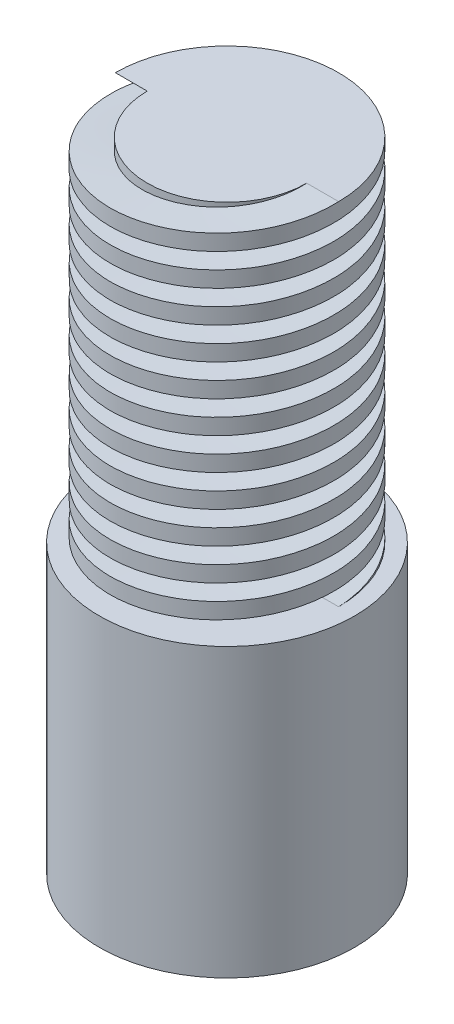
ISO-10303-21;
HEADER;
FILE_DESCRIPTION(('STEP AP214'),'2;1');
FILE_NAME('part.step','',(''),(''),'','','');
FILE_SCHEMA(('AUTOMOTIVE_DESIGN { 1 0 10303 214 1 1 1 1 }'));
ENDSEC;
DATA;
#1=APPLICATION_CONTEXT('core data for automotive mechanical design processes');
#2=APPLICATION_PROTOCOL_DEFINITION('international standard','automotive_design',2000,#1);
#3=PRODUCT_CONTEXT('',#1,'mechanical');
#4=PRODUCT('Part','Part','',(#3));
#5=PRODUCT_RELATED_PRODUCT_CATEGORY('part','',(#4));
#6=PRODUCT_DEFINITION_FORMATION('','',#4);
#7=PRODUCT_DEFINITION_CONTEXT('part definition',#1,'design');
#8=PRODUCT_DEFINITION('design','',#6,#7);
#9=PRODUCT_DEFINITION_SHAPE('','',#8);
#10=(LENGTH_UNIT() NAMED_UNIT(*) SI_UNIT(.MILLI.,.METRE.));
#11=(NAMED_UNIT(*) PLANE_ANGLE_UNIT() SI_UNIT($,.RADIAN.));
#12=(NAMED_UNIT(*) SI_UNIT($,.STERADIAN.) SOLID_ANGLE_UNIT());
#13=UNCERTAINTY_MEASURE_WITH_UNIT(LENGTH_MEASURE(1.E-05),#10,'distance_accuracy_value','');
#14=(GEOMETRIC_REPRESENTATION_CONTEXT(3) GLOBAL_UNCERTAINTY_ASSIGNED_CONTEXT((#13)) GLOBAL_UNIT_ASSIGNED_CONTEXT((#10,
#11,#12)) REPRESENTATION_CONTEXT('',''));
#15=CARTESIAN_POINT('',(0.,0.,0.));
#16=DIRECTION('',(0.,0.,1.));
#17=DIRECTION('',(1.,0.,0.));
#18=AXIS2_PLACEMENT_3D('',#15,#16,#17);
#19=CARTESIAN_POINT('',(-20.,45.,0.));
#20=DIRECTION('',(0.,1.,0.));
#21=DIRECTION('',(-1.,0.,0.));
#22=AXIS2_PLACEMENT_3D('',#19,#20,#21);
#23=PLANE('',#22);
#24=CARTESIAN_POINT('',(0.,45.,0.));
#25=DIRECTION('',(0.,1.,0.));
#26=DIRECTION('',(-1.,0.,0.));
#27=AXIS2_PLACEMENT_3D('',#24,#25,#26);
#28=CIRCLE('',#27,20.);
#29=CARTESIAN_POINT('',(-20.,45.,0.));
#30=VERTEX_POINT('',#29);
#31=EDGE_CURVE('E175',#30,#30,#28,.T.);
#32=ORIENTED_EDGE('',*,*,#31,.T.);
#33=EDGE_LOOP('',(#32));
#34=FACE_BOUND('',#33,.T.);
#35=CARTESIAN_POINT('',(0.,45.,0.));
#36=DIRECTION('',(0.,1.,0.));
#37=DIRECTION('',(-1.,0.,0.));
#38=AXIS2_PLACEMENT_3D('',#35,#36,#37);
#39=CIRCLE('',#38,17.5);
#40=CARTESIAN_POINT('',(17.5,45.0000000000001,-3.3766256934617E-13));
#41=VERTEX_POINT('',#40);
#42=CARTESIAN_POINT('',(-17.5,45.0000000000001,3.39805630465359E-13));
#43=VERTEX_POINT('',#42);
#44=EDGE_CURVE('E82',#41,#43,#39,.T.);
#45=ORIENTED_EDGE('',*,*,#44,.F.);
#46=CARTESIAN_POINT('',(12.5,45.0000000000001,-2.41187549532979E-13));
#47=CARTESIAN_POINT('',(12.9811252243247,45.0000000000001,1.23276031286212E-12));
#48=CARTESIAN_POINT('',(13.4622504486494,45.,2.05570582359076E-12));
#49=CARTESIAN_POINT('',(14.4245008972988,45.,2.96053530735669E-12));
#50=CARTESIAN_POINT('',(14.9056261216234,45.,3.04241928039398E-12));
#51=CARTESIAN_POINT('',(16.0911675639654,45.,3.02227472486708E-12));
#52=CARTESIAN_POINT('',(16.7955837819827,45.,2.81725509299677E-12));
#53=CARTESIAN_POINT('',(17.5,45.,3.29942805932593E-12));
#54=B_SPLINE_CURVE_WITH_KNOTS('',3,(#46,#47,#48,#49,#50,#51,#52,#53),.UNSPECIFIED.,.F.,.F.,(4,2,
2,4),(0.,1.44337567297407,2.88675134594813,5.),.UNSPECIFIED.);
#55=CARTESIAN_POINT('',(12.5,45.0000000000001,-2.7792574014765E-13));
#56=VERTEX_POINT('',#55);
#57=EDGE_CURVE('E48',#56,#41,#54,.T.);
#58=ORIENTED_EDGE('',*,*,#57,.F.);
#59=CARTESIAN_POINT('',(0.,45.,0.));
#60=DIRECTION('',(0.,1.,0.));
#61=DIRECTION('',(-1.,0.,0.));
#62=AXIS2_PLACEMENT_3D('',#59,#60,#61);
#63=CIRCLE('',#62,12.5);
#64=CARTESIAN_POINT('',(-12.5,45.0000000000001,4.12683261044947E-13));
#65=VERTEX_POINT('',#64);
#66=EDGE_CURVE('E11',#65,#56,#63,.T.);
#67=ORIENTED_EDGE('',*,*,#66,.F.);
#68=CARTESIAN_POINT('',(-17.5,45.0000000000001,3.39805630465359E-13));
#69=CARTESIAN_POINT('',(-17.0188747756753,45.0000000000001,-1.64981135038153E-12));
#70=CARTESIAN_POINT('',(-16.5377495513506,45.,-2.6195701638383E-12));
#71=CARTESIAN_POINT('',(-15.5754991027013,45.,-3.43108886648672E-12));
#72=CARTESIAN_POINT('',(-15.0943738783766,45.,-3.27284875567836E-12));
#73=CARTESIAN_POINT('',(-13.9088324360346,45.,-2.61645922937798E-12));
#74=CARTESIAN_POINT('',(-13.2044162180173,45.,-1.99464074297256E-12));
#75=CARTESIAN_POINT('',(-12.5,45.,-2.57169705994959E-12));
#76=B_SPLINE_CURVE_WITH_KNOTS('',3,(#68,#69,#70,#71,#72,#73,#74,#75),.UNSPECIFIED.,.F.,.F.,(4,2,
2,4),(0.,1.44337567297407,2.88675134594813,5.),.UNSPECIFIED.);
#77=EDGE_CURVE('E71',#43,#65,#76,.T.);
#78=ORIENTED_EDGE('',*,*,#77,.F.);
#79=EDGE_LOOP('',(#45,#58,#67,#78));
#80=FACE_BOUND('',#79,.T.);
#81=ADVANCED_FACE('F33',(#34,#80),#23,.T.);
#82=CARTESIAN_POINT('',(0.,45.,0.));
#83=DIRECTION('',(0.,1.,0.));
#84=DIRECTION('',(-1.,0.,0.));
#85=AXIS2_PLACEMENT_3D('',#82,#83,#84);
#86=CYLINDRICAL_SURFACE('',#85,20.);
#87=CARTESIAN_POINT('',(0.,0.,0.));
#88=DIRECTION('',(0.,1.,0.));
#89=DIRECTION('',(-1.,0.,0.));
#90=AXIS2_PLACEMENT_3D('',#87,#88,#89);
#91=CIRCLE('',#90,20.);
#92=CARTESIAN_POINT('',(-20.,0.,0.));
#93=VERTEX_POINT('',#92);
#94=EDGE_CURVE('E177',#93,#93,#91,.T.);
#95=ORIENTED_EDGE('',*,*,#94,.T.);
#96=EDGE_LOOP('',(#95));
#97=FACE_BOUND('',#96,.T.);
#98=ORIENTED_EDGE('',*,*,#31,.F.);
#99=EDGE_LOOP('',(#98));
#100=FACE_BOUND('',#99,.T.);
#101=ADVANCED_FACE('F135',(#97,#100),#86,.T.);
#102=CARTESIAN_POINT('',(0.,100.,0.));
#103=DIRECTION('',(0.,1.,0.));
#104=DIRECTION('',(0.,0.,1.));
#105=AXIS2_PLACEMENT_3D('',#102,#103,#104);
#106=PLANE('',#105);
#107=CARTESIAN_POINT('',(-17.5,100.,3.39805630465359E-13));
#108=CARTESIAN_POINT('',(-17.0188747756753,100.,-3.21316606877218E-13));
#109=CARTESIAN_POINT('',(-16.5377495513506,100.,-5.71434390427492E-13));
#110=CARTESIAN_POINT('',(-15.5754991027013,100.,-6.47369697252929E-13));
#111=CARTESIAN_POINT('',(-15.0943738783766,100.,-4.7318722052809E-13));
#112=CARTESIAN_POINT('',(-13.9088324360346,100.,0.));
#113=CARTESIAN_POINT('',(-13.2044162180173,100.,2.91766382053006E-13));
#114=CARTESIAN_POINT('',(-12.5,100.,0.));
#115=B_SPLINE_CURVE_WITH_KNOTS('',3,(#107,#108,#109,#110,#111,#112,#113,#114),.UNSPECIFIED.,.F.,
.F.,(4,2,2,4),(0.,1.44337567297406,2.88675134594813,5.),.UNSPECIFIED.);
#116=CARTESIAN_POINT('',(-17.5,100.,3.39805630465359E-13));
#117=VERTEX_POINT('',#116);
#118=CARTESIAN_POINT('',(-12.5,100.,2.45779823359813E-13));
#119=VERTEX_POINT('',#118);
#120=EDGE_CURVE('E87',#117,#119,#115,.T.);
#121=ORIENTED_EDGE('',*,*,#120,.T.);
#122=CARTESIAN_POINT('',(0.,100.,0.));
#123=DIRECTION('',(0.,1.,0.));
#124=DIRECTION('',(0.,0.,1.));
#125=AXIS2_PLACEMENT_3D('',#122,#123,#124);
#126=CIRCLE('',#125,12.5);
#127=CARTESIAN_POINT('',(12.5,100.,-2.41187549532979E-13));
#128=VERTEX_POINT('',#127);
#129=EDGE_CURVE('E86',#119,#128,#126,.T.);
#130=ORIENTED_EDGE('',*,*,#129,.T.);
#131=CARTESIAN_POINT('',(12.5,100.,-2.41187549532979E-13));
#132=CARTESIAN_POINT('',(12.9811252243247,100.,-1.14071927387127E-13));
#133=CARTESIAN_POINT('',(13.4622504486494,100.,0.));
#134=CARTESIAN_POINT('',(14.4245008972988,100.,0.));
#135=CARTESIAN_POINT('',(14.9056261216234,100.,0.));
#136=CARTESIAN_POINT('',(16.0911675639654,100.,0.));
#137=CARTESIAN_POINT('',(16.7955837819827,100.,-1.70460959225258E-13));
#138=CARTESIAN_POINT('',(17.5,100.,-3.3766256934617E-13));
#139=B_SPLINE_CURVE_WITH_KNOTS('',3,(#131,#132,#133,#134,#135,#136,#137,#138),.UNSPECIFIED.,.F.,
.F.,(4,2,2,4),(0.,1.44337567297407,2.88675134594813,5.),.UNSPECIFIED.);
#140=CARTESIAN_POINT('',(17.5,100.,-3.41948691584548E-13));
#141=VERTEX_POINT('',#140);
#142=EDGE_CURVE('E89',#128,#141,#139,.T.);
#143=ORIENTED_EDGE('',*,*,#142,.T.);
#144=CARTESIAN_POINT('',(0.,100.,0.));
#145=DIRECTION('',(0.,1.,0.));
#146=DIRECTION('',(0.,0.,1.));
#147=AXIS2_PLACEMENT_3D('',#144,#145,#146);
#148=CIRCLE('',#147,17.5);
#149=EDGE_CURVE('E41',#141,#117,#148,.T.);
#150=ORIENTED_EDGE('',*,*,#149,.T.);
#151=EDGE_LOOP('',(#121,#130,#143,#150));
#152=FACE_BOUND('',#151,.T.);
#153=ADVANCED_FACE('F140',(#152),#106,.T.);
#154=CARTESIAN_POINT('',(0.,100.,0.));
#155=DIRECTION('',(0.,-1.,0.));
#156=DIRECTION('',(0.,0.,-1.));
#157=AXIS2_PLACEMENT_3D('',#154,#155,#156);
#158=CYLINDRICAL_SURFACE('',#157,12.5);
#159=CARTESIAN_POINT('',(12.5,107.5,-2.41187549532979E-13));
#160=CARTESIAN_POINT('',(12.5000000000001,107.083333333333,7.21687836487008));
#161=CARTESIAN_POINT('',(6.25000000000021,106.666666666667,10.8253175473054));
#162=CARTESIAN_POINT('',(2.79383176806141E-13,106.25,14.4337567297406));
#163=CARTESIAN_POINT('',(-6.24999999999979,105.833333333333,10.8253175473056));
#164=CARTESIAN_POINT('',(-12.4999999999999,105.416666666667,7.21687836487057));
#165=CARTESIAN_POINT('',(-12.5,105.,2.42718307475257E-13));
#166=CARTESIAN_POINT('',(-12.5000000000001,104.583333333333,-7.21687836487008));
#167=CARTESIAN_POINT('',(-6.25000000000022,104.166666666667,-10.8253175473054));
#168=CARTESIAN_POINT('',(-2.81150743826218E-13,103.75,-14.4337567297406));
#169=CARTESIAN_POINT('',(6.24999999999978,103.333333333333,-10.8253175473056));
#170=CARTESIAN_POINT('',(12.4999999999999,102.916666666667,-7.21687836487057));
#171=CARTESIAN_POINT('',(12.5,102.5,-2.44249065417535E-13));
#172=CARTESIAN_POINT('',(12.5000000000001,102.083333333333,7.21687836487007));
#173=CARTESIAN_POINT('',(6.25000000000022,101.666666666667,10.8253175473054));
#174=CARTESIAN_POINT('',(2.95738062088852E-13,101.25,14.4337567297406));
#175=CARTESIAN_POINT('',(-6.24999999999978,100.833333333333,10.8253175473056));
#176=CARTESIAN_POINT('',(-12.4999999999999,100.416666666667,7.21687836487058));
#177=CARTESIAN_POINT('',(-12.5,100.,2.45779823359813E-13));
#178=CARTESIAN_POINT('',(-12.5000000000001,99.5833333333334,-7.21687836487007));
#179=CARTESIAN_POINT('',(-6.25000000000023,99.1666666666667,-10.8253175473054));
#180=CARTESIAN_POINT('',(-2.84685877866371E-13,98.75,-14.4337567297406));
#181=CARTESIAN_POINT('',(6.24999999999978,98.3333333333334,-10.8253175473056));
#182=CARTESIAN_POINT('',(12.4999999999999,97.9166666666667,-7.21687836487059));
#183=CARTESIAN_POINT('',(12.5,97.5,-2.4731058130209E-13));
#184=CARTESIAN_POINT('',(12.5000000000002,97.0833333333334,7.21687836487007));
#185=CARTESIAN_POINT('',(6.25000000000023,96.6666666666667,10.8253175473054));
#186=CARTESIAN_POINT('',(3.12092947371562E-13,96.25,14.4337567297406));
#187=CARTESIAN_POINT('',(-6.24999999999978,95.8333333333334,10.8253175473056));
#188=CARTESIAN_POINT('',(-12.4999999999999,95.4166666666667,7.21687836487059));
#189=CARTESIAN_POINT('',(-12.5,95.,2.71045799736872E-13));
#190=CARTESIAN_POINT('',(-12.5000000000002,94.5833333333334,-7.21687836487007));
#191=CARTESIAN_POINT('',(-6.25000000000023,94.1666666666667,-10.8253175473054));
#192=CARTESIAN_POINT('',(-3.13860514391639E-13,93.75,-14.4337567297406));
#193=CARTESIAN_POINT('',(6.24999999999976,93.3333333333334,-10.8253175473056));
#194=CARTESIAN_POINT('',(12.4999999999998,92.9166666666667,-7.21687836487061));
#195=CARTESIAN_POINT('',(12.5,92.5,-2.50372097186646E-13));
#196=CARTESIAN_POINT('',(12.5000000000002,92.0833333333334,7.21687836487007));
#197=CARTESIAN_POINT('',(6.25000000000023,91.6666666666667,10.8253175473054));
#198=CARTESIAN_POINT('',(3.15628081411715E-13,91.25,14.4337567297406));
#199=CARTESIAN_POINT('',(-6.24999999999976,90.8333333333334,10.8253175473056));
#200=CARTESIAN_POINT('',(-12.4999999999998,90.4166666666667,7.21687836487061));
#201=CARTESIAN_POINT('',(-12.5,90.,2.51902855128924E-13));
#202=CARTESIAN_POINT('',(-12.5000000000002,89.5833333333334,-7.21687836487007));
#203=CARTESIAN_POINT('',(-6.25000000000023,89.1666666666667,-10.8253175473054));
#204=CARTESIAN_POINT('',(-3.17395648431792E-13,88.7500000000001,-14.4337567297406));
#205=CARTESIAN_POINT('',(6.24999999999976,88.3333333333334,-10.8253175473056));
#206=CARTESIAN_POINT('',(12.4999999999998,87.9166666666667,-7.21687836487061));
#207=CARTESIAN_POINT('',(12.5,87.5000000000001,-2.53433613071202E-13));
#208=CARTESIAN_POINT('',(12.5000000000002,87.0833333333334,7.21687836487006));
#209=CARTESIAN_POINT('',(6.25000000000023,86.6666666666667,10.8253175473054));
#210=CARTESIAN_POINT('',(3.19163215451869E-13,86.2500000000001,14.4337567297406));
#211=CARTESIAN_POINT('',(-6.24999999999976,85.8333333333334,10.8253175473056));
#212=CARTESIAN_POINT('',(-12.4999999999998,85.4166666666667,7.21687836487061));
#213=CARTESIAN_POINT('',(-12.5,85.,2.99373291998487E-13));
#214=CARTESIAN_POINT('',(-12.5000000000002,84.5833333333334,-7.21687836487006));
#215=CARTESIAN_POINT('',(-6.25000000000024,84.1666666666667,-10.8253175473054));
#216=CARTESIAN_POINT('',(-3.20930782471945E-13,83.7500000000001,-14.4337567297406));
#217=CARTESIAN_POINT('',(6.24999999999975,83.3333333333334,-10.8253175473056));
#218=CARTESIAN_POINT('',(12.4999999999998,82.9166666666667,-7.21687836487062));
#219=CARTESIAN_POINT('',(12.5,82.5000000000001,-3.00904049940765E-13));
#220=CARTESIAN_POINT('',(12.5000000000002,82.0833333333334,7.21687836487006));
#221=CARTESIAN_POINT('',(6.25000000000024,81.6666666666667,10.8253175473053));
#222=CARTESIAN_POINT('',(3.73977354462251E-13,81.2500000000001,14.4337567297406));
#223=CARTESIAN_POINT('',(-6.24999999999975,80.8333333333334,10.8253175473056));
#224=CARTESIAN_POINT('',(-12.4999999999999,80.4166666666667,7.21687836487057));
#225=CARTESIAN_POINT('',(-12.5,80.0000000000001,3.02434807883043E-13));
#226=CARTESIAN_POINT('',(-12.5000000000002,79.5833333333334,-7.21687836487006));
#227=CARTESIAN_POINT('',(-6.25000000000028,79.1666666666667,-10.8253175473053));
#228=CARTESIAN_POINT('',(-3.24465916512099E-13,78.7500000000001,-14.4337567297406));
#229=CARTESIAN_POINT('',(6.24999999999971,78.3333333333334,-10.8253175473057));
#230=CARTESIAN_POINT('',(12.4999999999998,77.9166666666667,-7.21687836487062));
#231=CARTESIAN_POINT('',(12.5,77.5000000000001,-2.59556644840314E-13));
#232=CARTESIAN_POINT('',(12.5000000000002,77.0833333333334,7.21687836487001));
#233=CARTESIAN_POINT('',(6.25000000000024,76.6666666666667,10.8253175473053));
#234=CARTESIAN_POINT('',(3.77512488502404E-13,76.2500000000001,14.4337567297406));
#235=CARTESIAN_POINT('',(-6.24999999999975,75.8333333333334,10.8253175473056));
#236=CARTESIAN_POINT('',(-12.4999999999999,75.4166666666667,7.21687836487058));
#237=CARTESIAN_POINT('',(-12.5,75.0000000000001,3.05496323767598E-13));
#238=CARTESIAN_POINT('',(-12.5000000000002,74.5833333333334,-7.21687836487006));
#239=CARTESIAN_POINT('',(-6.25000000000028,74.1666666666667,-10.8253175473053));
#240=CARTESIAN_POINT('',(-3.28001050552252E-13,73.7500000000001,-14.4337567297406));
#241=CARTESIAN_POINT('',(6.24999999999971,73.3333333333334,-10.8253175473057));
#242=CARTESIAN_POINT('',(12.4999999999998,72.9166666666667,-7.21687836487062));
#243=CARTESIAN_POINT('',(12.5,72.5000000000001,-2.6261816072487E-13));
#244=CARTESIAN_POINT('',(12.5000000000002,72.0833333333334,7.21687836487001));
#245=CARTESIAN_POINT('',(6.25000000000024,71.6666666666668,10.8253175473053));
#246=CARTESIAN_POINT('',(3.81047622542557E-13,71.2500000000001,14.4337567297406));
#247=CARTESIAN_POINT('',(-6.24999999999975,70.8333333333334,10.8253175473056));
#248=CARTESIAN_POINT('',(-12.4999999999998,70.4166666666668,7.21687836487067));
#249=CARTESIAN_POINT('',(-12.5,70.0000000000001,3.08557839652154E-13));
#250=CARTESIAN_POINT('',(-12.5000000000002,69.5833333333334,-7.21687836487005));
#251=CARTESIAN_POINT('',(-6.25000000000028,69.1666666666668,-10.8253175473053));
#252=CARTESIAN_POINT('',(-3.31536184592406E-13,68.7500000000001,-14.4337567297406));
#253=CARTESIAN_POINT('',(6.24999999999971,68.3333333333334,-10.8253175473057));
#254=CARTESIAN_POINT('',(12.4999999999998,67.9166666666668,-7.21687836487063));
#255=CARTESIAN_POINT('',(12.5,67.5000000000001,-2.65679676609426E-13));
#256=CARTESIAN_POINT('',(12.5000000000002,67.0833333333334,7.21687836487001));
#257=CARTESIAN_POINT('',(6.25000000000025,66.6666666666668,10.8253175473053));
#258=CARTESIAN_POINT('',(3.84582756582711E-13,66.2500000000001,14.4337567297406));
#259=CARTESIAN_POINT('',(-6.24999999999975,65.8333333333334,10.8253175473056));
#260=CARTESIAN_POINT('',(-12.4999999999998,65.4166666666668,7.21687836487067));
#261=CARTESIAN_POINT('',(-12.5,65.0000000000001,3.1161935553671E-13));
#262=CARTESIAN_POINT('',(-12.5000000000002,64.5833333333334,-7.21687836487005));
#263=CARTESIAN_POINT('',(-6.25000000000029,64.1666666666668,-10.8253175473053));
#264=CARTESIAN_POINT('',(-3.35071318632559E-13,63.7500000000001,-14.4337567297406));
#265=CARTESIAN_POINT('',(6.24999999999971,63.3333333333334,-10.8253175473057));
#266=CARTESIAN_POINT('',(12.4999999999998,62.9166666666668,-7.21687836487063));
#267=CARTESIAN_POINT('',(12.5,62.5000000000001,-3.57559034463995E-13));
#268=CARTESIAN_POINT('',(12.5000000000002,62.0833333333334,7.21687836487));
#269=CARTESIAN_POINT('',(6.25000000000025,61.6666666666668,10.8253175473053));
#270=CARTESIAN_POINT('',(3.88117890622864E-13,61.2500000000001,14.4337567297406));
#271=CARTESIAN_POINT('',(-6.24999999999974,60.8333333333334,10.8253175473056));
#272=CARTESIAN_POINT('',(-12.4999999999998,60.4166666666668,7.21687836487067));
#273=CARTESIAN_POINT('',(-12.5,60.0000000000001,3.14680871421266E-13));
#274=CARTESIAN_POINT('',(-12.5000000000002,59.5833333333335,-7.21687836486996));
#275=CARTESIAN_POINT('',(-6.25000000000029,59.1666666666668,-10.8253175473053));
#276=CARTESIAN_POINT('',(-3.38606452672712E-13,58.7500000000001,-14.4337567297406));
#277=CARTESIAN_POINT('',(6.2499999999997,58.3333333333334,-10.8253175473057));
#278=CARTESIAN_POINT('',(12.4999999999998,57.9166666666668,-7.21687836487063));
#279=CARTESIAN_POINT('',(12.5,57.5000000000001,-3.60620550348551E-13));
#280=CARTESIAN_POINT('',(12.5000000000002,57.0833333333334,7.21687836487));
#281=CARTESIAN_POINT('',(6.25000000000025,56.6666666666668,10.8253175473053));
#282=CARTESIAN_POINT('',(3.91653024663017E-13,56.2500000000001,14.4337567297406));
#283=CARTESIAN_POINT('',(-6.24999999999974,55.8333333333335,10.8253175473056));
#284=CARTESIAN_POINT('',(-12.4999999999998,55.4166666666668,7.21687836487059));
#285=CARTESIAN_POINT('',(-12.5,55.0000000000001,4.06560229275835E-13));
#286=CARTESIAN_POINT('',(-12.5000000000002,54.5833333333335,-7.21687836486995));
#287=CARTESIAN_POINT('',(-6.25000000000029,54.1666666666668,-10.8253175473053));
#288=CARTESIAN_POINT('',(-3.42141586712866E-13,53.7500000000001,-14.4337567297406));
#289=CARTESIAN_POINT('',(6.24999999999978,53.3333333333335,-10.8253175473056));
#290=CARTESIAN_POINT('',(12.4999999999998,52.9166666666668,-7.21687836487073));
#291=CARTESIAN_POINT('',(12.5,52.5000000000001,-3.63682066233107E-13));
#292=CARTESIAN_POINT('',(12.5000000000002,52.0833333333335,7.21687836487));
#293=CARTESIAN_POINT('',(6.25000000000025,51.6666666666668,10.8253175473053));
#294=CARTESIAN_POINT('',(2.92630148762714E-13,51.2500000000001,14.4337567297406));
#295=CARTESIAN_POINT('',(-6.24999999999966,50.8333333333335,10.8253175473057));
#296=CARTESIAN_POINT('',(-12.4999999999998,50.4166666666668,7.21687836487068));
#297=CARTESIAN_POINT('',(-12.5,50.0000000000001,3.20803903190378E-13));
#298=CARTESIAN_POINT('',(-12.5000000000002,49.5833333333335,-7.21687836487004));
#299=CARTESIAN_POINT('',(-6.25000000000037,49.1666666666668,-10.8253175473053));
#300=CARTESIAN_POINT('',(-4.48234730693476E-13,48.7500000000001,-14.4337567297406));
#301=CARTESIAN_POINT('',(6.2499999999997,48.3333333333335,-10.8253175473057));
#302=CARTESIAN_POINT('',(12.4999999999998,47.9166666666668,-7.21687836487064));
#303=CARTESIAN_POINT('',(12.5,47.5000000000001,-2.7792574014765E-13));
#304=CARTESIAN_POINT('',(12.5000000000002,47.0833333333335,7.21687836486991));
#305=CARTESIAN_POINT('',(6.25000000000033,46.6666666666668,10.8253175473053));
#306=CARTESIAN_POINT('',(3.98723292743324E-13,46.2500000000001,14.4337567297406));
#307=CARTESIAN_POINT('',(-6.24999999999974,45.8333333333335,10.8253175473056));
#308=CARTESIAN_POINT('',(-12.4999999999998,45.4166666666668,7.2168783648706));
#309=CARTESIAN_POINT('',(-12.5,45.0000000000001,4.12683261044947E-13));
#310=CARTESIAN_POINT('',(-12.5000000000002,44.5833333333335,-7.21687836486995));
#311=CARTESIAN_POINT('',(-6.2500000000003,44.1666666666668,-10.8253175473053));
#312=CARTESIAN_POINT('',(-3.49211854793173E-13,43.7500000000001,-14.4337567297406));
#313=CARTESIAN_POINT('',(6.24999999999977,43.3333333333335,-10.8253175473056));
#314=CARTESIAN_POINT('',(12.4999999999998,42.9166666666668,-7.21687836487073));
#315=CARTESIAN_POINT('',(12.5,42.5000000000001,-3.69805098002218E-13));
#316=(BOUNDED_CURVE() B_SPLINE_CURVE(2,(#159,#160,#161,#162,#163,#164,#165,#166,#167,#168,#169,
#170,#171,#172,#173,#174,#175,#176,#177,#178,#179,#180,#181,#182,#183,#184,#185,#186,#187,#188,
#189,#190,#191,#192,#193,#194,#195,#196,#197,#198,#199,#200,#201,#202,#203,#204,#205,#206,#207,
#208,#209,#210,#211,#212,#213,#214,#215,#216,#217,#218,#219,#220,#221,#222,#223,#224,#225,#226,
#227,#228,#229,#230,#231,#232,#233,#234,#235,#236,#237,#238,#239,#240,#241,#242,#243,#244,#245,
#246,#247,#248,#249,#250,#251,#252,#253,#254,#255,#256,#257,#258,#259,#260,#261,#262,#263,#264,
#265,#266,#267,#268,#269,#270,#271,#272,#273,#274,#275,#276,#277,#278,#279,#280,#281,#282,#283,
#284,#285,#286,#287,#288,#289,#290,#291,#292,#293,#294,#295,#296,#297,#298,#299,#300,#301,#302,
#303,#304,#305,#306,#307,#308,#309,#310,#311,#312,#313,#314,#315),.UNSPECIFIED.,.F.,
.F.) B_SPLINE_CURVE_WITH_KNOTS((3,2,2,2,2,2,2,2,2,2,2,2,2,2,2,2,2,2,2,2,2,2,2,2,2,2,2,2,2,2,2,2,
2,2,2,2,2,2,2,2,2,2,2,2,2,2,2,2,2,2,2,2,2,2,2,2,2,2,2,2,2,2,2,2,2,2,2,2,2,2,2,2,2,2,2,2,2,2,3),
(0.,0.0128205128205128,0.0256410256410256,0.0384615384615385,0.0512820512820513,
0.0641025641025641,0.0769230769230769,0.0897435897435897,0.102564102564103,0.115384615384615,
0.128205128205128,0.141025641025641,0.153846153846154,0.166666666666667,0.179487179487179,
0.192307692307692,0.205128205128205,0.217948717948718,0.230769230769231,0.243589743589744,
0.256410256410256,0.269230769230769,0.282051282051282,0.294871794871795,0.307692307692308,
0.32051282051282,0.333333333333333,0.346153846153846,0.358974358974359,0.371794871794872,
0.384615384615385,0.397435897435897,0.41025641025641,0.423076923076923,0.435897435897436,
0.448717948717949,0.461538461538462,0.474358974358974,0.487179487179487,0.5,0.512820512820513,
0.525641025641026,0.538461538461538,0.551282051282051,0.564102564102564,0.576923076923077,
0.58974358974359,0.602564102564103,0.615384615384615,0.628205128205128,0.641025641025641,
0.653846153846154,0.666666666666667,0.67948717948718,0.692307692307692,0.705128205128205,
0.717948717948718,0.730769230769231,0.743589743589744,0.756410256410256,0.769230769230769,
0.782051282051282,0.794871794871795,0.807692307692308,0.82051282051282,0.833333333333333,
0.846153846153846,0.858974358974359,0.871794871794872,0.884615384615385,0.897435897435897,
0.91025641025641,0.923076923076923,0.935897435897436,0.948717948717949,0.961538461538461,
0.974358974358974,0.987179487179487,1.),
.UNSPECIFIED.) CURVE() GEOMETRIC_REPRESENTATION_ITEM() RATIONAL_B_SPLINE_CURVE((1.,
0.866025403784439,1.,0.866025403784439,1.,0.866025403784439,1.,0.866025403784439,1.,
0.866025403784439,1.,0.866025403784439,1.,0.866025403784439,1.,0.866025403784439,1.,
0.866025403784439,1.,0.866025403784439,1.,0.866025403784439,1.,0.866025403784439,1.,
0.866025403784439,1.,0.866025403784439,1.,0.866025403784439,1.,0.866025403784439,1.,
0.866025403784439,1.,0.866025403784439,1.,0.866025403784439,1.,0.866025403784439,1.,
0.866025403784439,1.,0.866025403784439,1.,0.866025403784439,1.,0.866025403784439,1.,
0.866025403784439,1.,0.866025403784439,1.,0.866025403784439,1.,0.866025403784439,1.,
0.866025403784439,1.,0.866025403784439,1.,0.866025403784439,1.,0.866025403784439,1.,
0.866025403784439,1.,0.866025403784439,1.,0.866025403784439,1.,0.866025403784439,1.,
0.866025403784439,1.,0.866025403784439,1.,0.866025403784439,1.,0.866025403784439,1.,
0.866025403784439,1.,0.866025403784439,1.,0.866025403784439,1.,0.866025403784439,1.,
0.866025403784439,1.,0.866025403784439,1.,0.866025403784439,1.,0.866025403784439,1.,
0.866025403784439,1.,0.866025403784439,1.,0.866025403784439,1.,0.866025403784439,1.,
0.866025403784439,1.,0.866025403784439,1.,0.866025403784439,1.,0.866025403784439,1.,
0.866025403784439,1.,0.866025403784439,1.,0.866025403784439,1.,0.866025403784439,1.,
0.866025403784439,1.,0.866025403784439,1.,0.866025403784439,1.,0.866025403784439,1.,
0.866025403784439,1.,0.866025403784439,1.,0.866025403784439,1.,0.866025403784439,1.,
0.866025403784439,1.,0.866025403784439,1.,0.866025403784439,1.,0.866025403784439,1.,
0.866025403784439,1.,0.866025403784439,1.,0.866025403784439,1.,0.866025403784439,1.,
0.866025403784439,1.,0.866025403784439,1.)) REPRESENTATION_ITEM(''));
#317=EDGE_CURVE('E78',#119,#65,#316,.T.);
#318=ORIENTED_EDGE('',*,*,#317,.T.);
#319=ORIENTED_EDGE('',*,*,#66,.T.);
#320=CARTESIAN_POINT('',(12.5,105.,-2.41187549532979E-13));
#321=CARTESIAN_POINT('',(12.5000000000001,104.583333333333,7.21687836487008));
#322=CARTESIAN_POINT('',(6.25000000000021,104.166666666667,10.8253175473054));
#323=CARTESIAN_POINT('',(2.79383176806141E-13,103.75,14.4337567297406));
#324=CARTESIAN_POINT('',(-6.24999999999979,103.333333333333,10.8253175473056));
#325=CARTESIAN_POINT('',(-12.4999999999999,102.916666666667,7.21687836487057));
#326=CARTESIAN_POINT('',(-12.5,102.5,2.42718307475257E-13));
#327=CARTESIAN_POINT('',(-12.5000000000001,102.083333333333,-7.21687836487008));
#328=CARTESIAN_POINT('',(-6.25000000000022,101.666666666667,-10.8253175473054));
#329=CARTESIAN_POINT('',(-2.81150743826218E-13,101.25,-14.4337567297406));
#330=CARTESIAN_POINT('',(6.24999999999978,100.833333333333,-10.8253175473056));
#331=CARTESIAN_POINT('',(12.4999999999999,100.416666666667,-7.21687836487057));
#332=CARTESIAN_POINT('',(12.5,100.,-2.44249065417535E-13));
#333=CARTESIAN_POINT('',(12.5000000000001,99.5833333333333,7.21687836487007));
#334=CARTESIAN_POINT('',(6.25000000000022,99.1666666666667,10.8253175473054));
#335=CARTESIAN_POINT('',(2.95738062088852E-13,98.75,14.4337567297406));
#336=CARTESIAN_POINT('',(-6.24999999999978,98.3333333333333,10.8253175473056));
#337=CARTESIAN_POINT('',(-12.4999999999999,97.9166666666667,7.21687836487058));
#338=CARTESIAN_POINT('',(-12.5,97.5,2.45779823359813E-13));
#339=CARTESIAN_POINT('',(-12.5000000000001,97.0833333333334,-7.21687836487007));
#340=CARTESIAN_POINT('',(-6.25000000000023,96.6666666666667,-10.8253175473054));
#341=CARTESIAN_POINT('',(-2.84685877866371E-13,96.25,-14.4337567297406));
#342=CARTESIAN_POINT('',(6.24999999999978,95.8333333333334,-10.8253175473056));
#343=CARTESIAN_POINT('',(12.4999999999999,95.4166666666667,-7.21687836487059));
#344=CARTESIAN_POINT('',(12.5,95.,-2.4731058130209E-13));
#345=CARTESIAN_POINT('',(12.5000000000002,94.5833333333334,7.21687836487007));
#346=CARTESIAN_POINT('',(6.25000000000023,94.1666666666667,10.8253175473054));
#347=CARTESIAN_POINT('',(3.12092947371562E-13,93.75,14.4337567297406));
#348=CARTESIAN_POINT('',(-6.24999999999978,93.3333333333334,10.8253175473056));
#349=CARTESIAN_POINT('',(-12.4999999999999,92.9166666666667,7.21687836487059));
#350=CARTESIAN_POINT('',(-12.5,92.5,2.71045799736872E-13));
#351=CARTESIAN_POINT('',(-12.5000000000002,92.0833333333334,-7.21687836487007));
#352=CARTESIAN_POINT('',(-6.25000000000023,91.6666666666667,-10.8253175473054));
#353=CARTESIAN_POINT('',(-3.13860514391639E-13,91.25,-14.4337567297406));
#354=CARTESIAN_POINT('',(6.24999999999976,90.8333333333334,-10.8253175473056));
#355=CARTESIAN_POINT('',(12.4999999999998,90.4166666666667,-7.21687836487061));
#356=CARTESIAN_POINT('',(12.5,90.,-2.50372097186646E-13));
#357=CARTESIAN_POINT('',(12.5000000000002,89.5833333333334,7.21687836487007));
#358=CARTESIAN_POINT('',(6.25000000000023,89.1666666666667,10.8253175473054));
#359=CARTESIAN_POINT('',(3.15628081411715E-13,88.75,14.4337567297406));
#360=CARTESIAN_POINT('',(-6.24999999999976,88.3333333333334,10.8253175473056));
#361=CARTESIAN_POINT('',(-12.4999999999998,87.9166666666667,7.21687836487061));
#362=CARTESIAN_POINT('',(-12.5,87.5,2.51902855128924E-13));
#363=CARTESIAN_POINT('',(-12.5000000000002,87.0833333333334,-7.21687836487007));
#364=CARTESIAN_POINT('',(-6.25000000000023,86.6666666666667,-10.8253175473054));
#365=CARTESIAN_POINT('',(-3.17395648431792E-13,86.2500000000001,-14.4337567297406));
#366=CARTESIAN_POINT('',(6.24999999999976,85.8333333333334,-10.8253175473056));
#367=CARTESIAN_POINT('',(12.4999999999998,85.4166666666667,-7.21687836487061));
#368=CARTESIAN_POINT('',(12.5,85.,-2.53433613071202E-13));
#369=CARTESIAN_POINT('',(12.5000000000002,84.5833333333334,7.21687836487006));
#370=CARTESIAN_POINT('',(6.25000000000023,84.1666666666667,10.8253175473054));
#371=CARTESIAN_POINT('',(3.19163215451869E-13,83.75,14.4337567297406));
#372=CARTESIAN_POINT('',(-6.24999999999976,83.3333333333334,10.8253175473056));
#373=CARTESIAN_POINT('',(-12.4999999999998,82.9166666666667,7.21687836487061));
#374=CARTESIAN_POINT('',(-12.5,82.5,2.99373291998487E-13));
#375=CARTESIAN_POINT('',(-12.5000000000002,82.0833333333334,-7.21687836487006));
#376=CARTESIAN_POINT('',(-6.25000000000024,81.6666666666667,-10.8253175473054));
#377=CARTESIAN_POINT('',(-3.20930782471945E-13,81.2500000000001,-14.4337567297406));
#378=CARTESIAN_POINT('',(6.24999999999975,80.8333333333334,-10.8253175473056));
#379=CARTESIAN_POINT('',(12.4999999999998,80.4166666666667,-7.21687836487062));
#380=CARTESIAN_POINT('',(12.5,80.0000000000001,-3.00904049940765E-13));
#381=CARTESIAN_POINT('',(12.5000000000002,79.5833333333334,7.21687836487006));
#382=CARTESIAN_POINT('',(6.25000000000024,79.1666666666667,10.8253175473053));
#383=CARTESIAN_POINT('',(3.73977354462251E-13,78.7500000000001,14.4337567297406));
#384=CARTESIAN_POINT('',(-6.24999999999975,78.3333333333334,10.8253175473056));
#385=CARTESIAN_POINT('',(-12.4999999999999,77.9166666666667,7.21687836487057));
#386=CARTESIAN_POINT('',(-12.5,77.5000000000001,3.02434807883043E-13));
#387=CARTESIAN_POINT('',(-12.5000000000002,77.0833333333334,-7.21687836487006));
#388=CARTESIAN_POINT('',(-6.25000000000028,76.6666666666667,-10.8253175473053));
#389=CARTESIAN_POINT('',(-3.24465916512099E-13,76.2500000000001,-14.4337567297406));
#390=CARTESIAN_POINT('',(6.24999999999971,75.8333333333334,-10.8253175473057));
#391=CARTESIAN_POINT('',(12.4999999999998,75.4166666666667,-7.21687836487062));
#392=CARTESIAN_POINT('',(12.5,75.0000000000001,-2.59556644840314E-13));
#393=CARTESIAN_POINT('',(12.5000000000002,74.5833333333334,7.21687836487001));
#394=CARTESIAN_POINT('',(6.25000000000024,74.1666666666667,10.8253175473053));
#395=CARTESIAN_POINT('',(3.77512488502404E-13,73.7500000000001,14.4337567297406));
#396=CARTESIAN_POINT('',(-6.24999999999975,73.3333333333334,10.8253175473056));
#397=CARTESIAN_POINT('',(-12.4999999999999,72.9166666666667,7.21687836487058));
#398=CARTESIAN_POINT('',(-12.5,72.5000000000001,3.05496323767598E-13));
#399=CARTESIAN_POINT('',(-12.5000000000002,72.0833333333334,-7.21687836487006));
#400=CARTESIAN_POINT('',(-6.25000000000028,71.6666666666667,-10.8253175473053));
#401=CARTESIAN_POINT('',(-3.28001050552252E-13,71.2500000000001,-14.4337567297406));
#402=CARTESIAN_POINT('',(6.24999999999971,70.8333333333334,-10.8253175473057));
#403=CARTESIAN_POINT('',(12.4999999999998,70.4166666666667,-7.21687836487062));
#404=CARTESIAN_POINT('',(12.5,70.0000000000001,-2.6261816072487E-13));
#405=CARTESIAN_POINT('',(12.5000000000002,69.5833333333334,7.21687836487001));
#406=CARTESIAN_POINT('',(6.25000000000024,69.1666666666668,10.8253175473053));
#407=CARTESIAN_POINT('',(3.81047622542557E-13,68.7500000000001,14.4337567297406));
#408=CARTESIAN_POINT('',(-6.24999999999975,68.3333333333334,10.8253175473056));
#409=CARTESIAN_POINT('',(-12.4999999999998,67.9166666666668,7.21687836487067));
#410=CARTESIAN_POINT('',(-12.5,67.5000000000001,3.08557839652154E-13));
#411=CARTESIAN_POINT('',(-12.5000000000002,67.0833333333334,-7.21687836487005));
#412=CARTESIAN_POINT('',(-6.25000000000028,66.6666666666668,-10.8253175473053));
#413=CARTESIAN_POINT('',(-3.31536184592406E-13,66.2500000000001,-14.4337567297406));
#414=CARTESIAN_POINT('',(6.24999999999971,65.8333333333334,-10.8253175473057));
#415=CARTESIAN_POINT('',(12.4999999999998,65.4166666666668,-7.21687836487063));
#416=CARTESIAN_POINT('',(12.5,65.0000000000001,-2.65679676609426E-13));
#417=CARTESIAN_POINT('',(12.5000000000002,64.5833333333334,7.21687836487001));
#418=CARTESIAN_POINT('',(6.25000000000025,64.1666666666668,10.8253175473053));
#419=CARTESIAN_POINT('',(3.84582756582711E-13,63.7500000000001,14.4337567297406));
#420=CARTESIAN_POINT('',(-6.24999999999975,63.3333333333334,10.8253175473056));
#421=CARTESIAN_POINT('',(-12.4999999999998,62.9166666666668,7.21687836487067));
#422=CARTESIAN_POINT('',(-12.5,62.5000000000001,3.1161935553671E-13));
#423=CARTESIAN_POINT('',(-12.5000000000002,62.0833333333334,-7.21687836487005));
#424=CARTESIAN_POINT('',(-6.25000000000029,61.6666666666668,-10.8253175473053));
#425=CARTESIAN_POINT('',(-3.35071318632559E-13,61.2500000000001,-14.4337567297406));
#426=CARTESIAN_POINT('',(6.24999999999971,60.8333333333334,-10.8253175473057));
#427=CARTESIAN_POINT('',(12.4999999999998,60.4166666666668,-7.21687836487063));
#428=CARTESIAN_POINT('',(12.5,60.0000000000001,-3.57559034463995E-13));
#429=CARTESIAN_POINT('',(12.5000000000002,59.5833333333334,7.21687836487));
#430=CARTESIAN_POINT('',(6.25000000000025,59.1666666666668,10.8253175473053));
#431=CARTESIAN_POINT('',(3.88117890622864E-13,58.7500000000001,14.4337567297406));
#432=CARTESIAN_POINT('',(-6.24999999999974,58.3333333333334,10.8253175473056));
#433=CARTESIAN_POINT('',(-12.4999999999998,57.9166666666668,7.21687836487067));
#434=CARTESIAN_POINT('',(-12.5,57.5000000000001,3.14680871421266E-13));
#435=CARTESIAN_POINT('',(-12.5000000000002,57.0833333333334,-7.21687836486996));
#436=CARTESIAN_POINT('',(-6.25000000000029,56.6666666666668,-10.8253175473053));
#437=CARTESIAN_POINT('',(-3.38606452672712E-13,56.2500000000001,-14.4337567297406));
#438=CARTESIAN_POINT('',(6.2499999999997,55.8333333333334,-10.8253175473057));
#439=CARTESIAN_POINT('',(12.4999999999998,55.4166666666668,-7.21687836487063));
#440=CARTESIAN_POINT('',(12.5,55.0000000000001,-3.60620550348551E-13));
#441=CARTESIAN_POINT('',(12.5000000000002,54.5833333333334,7.21687836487));
#442=CARTESIAN_POINT('',(6.25000000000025,54.1666666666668,10.8253175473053));
#443=CARTESIAN_POINT('',(3.91653024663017E-13,53.7500000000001,14.4337567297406));
#444=CARTESIAN_POINT('',(-6.24999999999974,53.3333333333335,10.8253175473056));
#445=CARTESIAN_POINT('',(-12.4999999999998,52.9166666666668,7.21687836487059));
#446=CARTESIAN_POINT('',(-12.5,52.5000000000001,4.06560229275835E-13));
#447=CARTESIAN_POINT('',(-12.5000000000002,52.0833333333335,-7.21687836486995));
#448=CARTESIAN_POINT('',(-6.25000000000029,51.6666666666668,-10.8253175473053));
#449=CARTESIAN_POINT('',(-3.42141586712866E-13,51.2500000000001,-14.4337567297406));
#450=CARTESIAN_POINT('',(6.24999999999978,50.8333333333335,-10.8253175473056));
#451=CARTESIAN_POINT('',(12.4999999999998,50.4166666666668,-7.21687836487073));
#452=CARTESIAN_POINT('',(12.5,50.0000000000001,-3.63682066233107E-13));
#453=CARTESIAN_POINT('',(12.5000000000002,49.5833333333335,7.21687836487));
#454=CARTESIAN_POINT('',(6.25000000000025,49.1666666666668,10.8253175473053));
#455=CARTESIAN_POINT('',(2.92630148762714E-13,48.7500000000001,14.4337567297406));
#456=CARTESIAN_POINT('',(-6.24999999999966,48.3333333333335,10.8253175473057));
#457=CARTESIAN_POINT('',(-12.4999999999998,47.9166666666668,7.21687836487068));
#458=CARTESIAN_POINT('',(-12.5,47.5000000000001,3.20803903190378E-13));
#459=CARTESIAN_POINT('',(-12.5000000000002,47.0833333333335,-7.21687836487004));
#460=CARTESIAN_POINT('',(-6.25000000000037,46.6666666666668,-10.8253175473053));
#461=CARTESIAN_POINT('',(-4.48234730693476E-13,46.2500000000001,-14.4337567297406));
#462=CARTESIAN_POINT('',(6.2499999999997,45.8333333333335,-10.8253175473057));
#463=CARTESIAN_POINT('',(12.4999999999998,45.4166666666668,-7.21687836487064));
#464=CARTESIAN_POINT('',(12.5,45.0000000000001,-2.7792574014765E-13));
#465=CARTESIAN_POINT('',(12.5000000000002,44.5833333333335,7.21687836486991));
#466=CARTESIAN_POINT('',(6.25000000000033,44.1666666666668,10.8253175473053));
#467=CARTESIAN_POINT('',(3.98723292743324E-13,43.7500000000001,14.4337567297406));
#468=CARTESIAN_POINT('',(-6.24999999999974,43.3333333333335,10.8253175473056));
#469=CARTESIAN_POINT('',(-12.4999999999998,42.9166666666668,7.2168783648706));
#470=CARTESIAN_POINT('',(-12.5,42.5000000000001,4.12683261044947E-13));
#471=CARTESIAN_POINT('',(-12.5000000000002,42.0833333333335,-7.21687836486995));
#472=CARTESIAN_POINT('',(-6.2500000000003,41.6666666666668,-10.8253175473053));
#473=CARTESIAN_POINT('',(-3.49211854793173E-13,41.2500000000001,-14.4337567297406));
#474=CARTESIAN_POINT('',(6.24999999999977,40.8333333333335,-10.8253175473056));
#475=CARTESIAN_POINT('',(12.4999999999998,40.4166666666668,-7.21687836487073));
#476=CARTESIAN_POINT('',(12.5,40.0000000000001,-3.69805098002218E-13));
#477=(BOUNDED_CURVE() B_SPLINE_CURVE(2,(#320,#321,#322,#323,#324,#325,#326,#327,#328,#329,#330,
#331,#332,#333,#334,#335,#336,#337,#338,#339,#340,#341,#342,#343,#344,#345,#346,#347,#348,#349,
#350,#351,#352,#353,#354,#355,#356,#357,#358,#359,#360,#361,#362,#363,#364,#365,#366,#367,#368,
#369,#370,#371,#372,#373,#374,#375,#376,#377,#378,#379,#380,#381,#382,#383,#384,#385,#386,#387,
#388,#389,#390,#391,#392,#393,#394,#395,#396,#397,#398,#399,#400,#401,#402,#403,#404,#405,#406,
#407,#408,#409,#410,#411,#412,#413,#414,#415,#416,#417,#418,#419,#420,#421,#422,#423,#424,#425,
#426,#427,#428,#429,#430,#431,#432,#433,#434,#435,#436,#437,#438,#439,#440,#441,#442,#443,#444,
#445,#446,#447,#448,#449,#450,#451,#452,#453,#454,#455,#456,#457,#458,#459,#460,#461,#462,#463,
#464,#465,#466,#467,#468,#469,#470,#471,#472,#473,#474,#475,#476),.UNSPECIFIED.,.F.,
.F.) B_SPLINE_CURVE_WITH_KNOTS((3,2,2,2,2,2,2,2,2,2,2,2,2,2,2,2,2,2,2,2,2,2,2,2,2,2,2,2,2,2,2,2,
2,2,2,2,2,2,2,2,2,2,2,2,2,2,2,2,2,2,2,2,2,2,2,2,2,2,2,2,2,2,2,2,2,2,2,2,2,2,2,2,2,2,2,2,2,2,3),
(0.,0.0128205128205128,0.0256410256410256,0.0384615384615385,0.0512820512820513,
0.0641025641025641,0.0769230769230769,0.0897435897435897,0.102564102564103,0.115384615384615,
0.128205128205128,0.141025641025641,0.153846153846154,0.166666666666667,0.179487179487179,
0.192307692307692,0.205128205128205,0.217948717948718,0.230769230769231,0.243589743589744,
0.256410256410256,0.269230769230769,0.282051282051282,0.294871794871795,0.307692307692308,
0.32051282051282,0.333333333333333,0.346153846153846,0.358974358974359,0.371794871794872,
0.384615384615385,0.397435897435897,0.41025641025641,0.423076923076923,0.435897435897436,
0.448717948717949,0.461538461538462,0.474358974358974,0.487179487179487,0.5,0.512820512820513,
0.525641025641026,0.538461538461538,0.551282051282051,0.564102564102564,0.576923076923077,
0.58974358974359,0.602564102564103,0.615384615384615,0.628205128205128,0.641025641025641,
0.653846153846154,0.666666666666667,0.67948717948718,0.692307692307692,0.705128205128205,
0.717948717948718,0.730769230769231,0.743589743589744,0.756410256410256,0.769230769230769,
0.782051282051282,0.794871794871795,0.807692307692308,0.82051282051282,0.833333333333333,
0.846153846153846,0.858974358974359,0.871794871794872,0.884615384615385,0.897435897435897,
0.91025641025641,0.923076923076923,0.935897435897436,0.948717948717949,0.961538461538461,
0.974358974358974,0.987179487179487,1.),
.UNSPECIFIED.) CURVE() GEOMETRIC_REPRESENTATION_ITEM() RATIONAL_B_SPLINE_CURVE((1.,
0.866025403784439,1.,0.866025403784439,1.,0.866025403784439,1.,0.866025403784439,1.,
0.866025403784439,1.,0.866025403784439,1.,0.866025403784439,1.,0.866025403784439,1.,
0.866025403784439,1.,0.866025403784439,1.,0.866025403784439,1.,0.866025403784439,1.,
0.866025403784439,1.,0.866025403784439,1.,0.866025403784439,1.,0.866025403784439,1.,
0.866025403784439,1.,0.866025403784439,1.,0.866025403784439,1.,0.866025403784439,1.,
0.866025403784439,1.,0.866025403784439,1.,0.866025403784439,1.,0.866025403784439,1.,
0.866025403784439,1.,0.866025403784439,1.,0.866025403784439,1.,0.866025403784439,1.,
0.866025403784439,1.,0.866025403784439,1.,0.866025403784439,1.,0.866025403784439,1.,
0.866025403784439,1.,0.866025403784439,1.,0.866025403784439,1.,0.866025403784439,1.,
0.866025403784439,1.,0.866025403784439,1.,0.866025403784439,1.,0.866025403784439,1.,
0.866025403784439,1.,0.866025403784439,1.,0.866025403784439,1.,0.866025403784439,1.,
0.866025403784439,1.,0.866025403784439,1.,0.866025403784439,1.,0.866025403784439,1.,
0.866025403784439,1.,0.866025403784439,1.,0.866025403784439,1.,0.866025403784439,1.,
0.866025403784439,1.,0.866025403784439,1.,0.866025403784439,1.,0.866025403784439,1.,
0.866025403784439,1.,0.866025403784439,1.,0.866025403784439,1.,0.866025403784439,1.,
0.866025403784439,1.,0.866025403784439,1.,0.866025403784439,1.,0.866025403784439,1.,
0.866025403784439,1.,0.866025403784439,1.,0.866025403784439,1.,0.866025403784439,1.,
0.866025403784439,1.,0.866025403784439,1.,0.866025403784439,1.,0.866025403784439,1.,
0.866025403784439,1.,0.866025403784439,1.,0.866025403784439,1.,0.866025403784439,1.,
0.866025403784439,1.,0.866025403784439,1.)) REPRESENTATION_ITEM(''));
#478=EDGE_CURVE('E54',#128,#56,#477,.T.);
#479=ORIENTED_EDGE('',*,*,#478,.F.);
#480=ORIENTED_EDGE('',*,*,#129,.F.);
#481=EDGE_LOOP('',(#318,#319,#479,#480));
#482=FACE_BOUND('',#481,.T.);
#483=ADVANCED_FACE('F84',(#482),#158,.T.);
#484=CARTESIAN_POINT('',(12.5,105.,-2.41187549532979E-13));
#485=CARTESIAN_POINT('',(12.5000000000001,104.583333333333,7.21687836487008));
#486=CARTESIAN_POINT('',(6.25000000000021,104.166666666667,10.8253175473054));
#487=CARTESIAN_POINT('',(2.79383176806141E-13,103.75,14.4337567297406));
#488=CARTESIAN_POINT('',(-6.24999999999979,103.333333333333,10.8253175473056));
#489=CARTESIAN_POINT('',(-12.4999999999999,102.916666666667,7.21687836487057));
#490=CARTESIAN_POINT('',(-12.5,102.5,2.42718307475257E-13));
#491=CARTESIAN_POINT('',(-12.5000000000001,102.083333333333,-7.21687836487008));
#492=CARTESIAN_POINT('',(-6.25000000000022,101.666666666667,-10.8253175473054));
#493=CARTESIAN_POINT('',(-2.81150743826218E-13,101.25,-14.4337567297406));
#494=CARTESIAN_POINT('',(6.24999999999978,100.833333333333,-10.8253175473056));
#495=CARTESIAN_POINT('',(12.4999999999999,100.416666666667,-7.21687836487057));
#496=CARTESIAN_POINT('',(12.5,100.,-2.41187549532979E-13));
#497=CARTESIAN_POINT('',(12.5000000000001,99.5833333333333,7.21687836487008));
#498=CARTESIAN_POINT('',(6.25000000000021,99.1666666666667,10.8253175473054));
#499=CARTESIAN_POINT('',(2.79383176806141E-13,98.75,14.4337567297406));
#500=CARTESIAN_POINT('',(-6.24999999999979,98.3333333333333,10.8253175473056));
#501=CARTESIAN_POINT('',(-12.4999999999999,97.9166666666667,7.21687836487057));
#502=CARTESIAN_POINT('',(-12.5,97.5,2.42718307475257E-13));
#503=CARTESIAN_POINT('',(-12.5000000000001,97.0833333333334,-7.21687836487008));
#504=CARTESIAN_POINT('',(-6.25000000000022,96.6666666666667,-10.8253175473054));
#505=CARTESIAN_POINT('',(-2.81150743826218E-13,96.25,-14.4337567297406));
#506=CARTESIAN_POINT('',(6.24999999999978,95.8333333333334,-10.8253175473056));
#507=CARTESIAN_POINT('',(12.4999999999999,95.4166666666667,-7.21687836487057));
#508=CARTESIAN_POINT('',(12.5,95.,-2.41187549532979E-13));
#509=CARTESIAN_POINT('',(12.5000000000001,94.5833333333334,7.21687836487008));
#510=CARTESIAN_POINT('',(6.25000000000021,94.1666666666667,10.8253175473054));
#511=CARTESIAN_POINT('',(2.79383176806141E-13,93.75,14.4337567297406));
#512=CARTESIAN_POINT('',(-6.24999999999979,93.3333333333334,10.8253175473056));
#513=CARTESIAN_POINT('',(-12.4999999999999,92.9166666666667,7.21687836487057));
#514=CARTESIAN_POINT('',(-12.5,92.5,2.42718307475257E-13));
#515=CARTESIAN_POINT('',(-12.5000000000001,92.0833333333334,-7.21687836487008));
#516=CARTESIAN_POINT('',(-6.25000000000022,91.6666666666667,-10.8253175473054));
#517=CARTESIAN_POINT('',(-2.81150743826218E-13,91.25,-14.4337567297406));
#518=CARTESIAN_POINT('',(6.24999999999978,90.8333333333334,-10.8253175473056));
#519=CARTESIAN_POINT('',(12.4999999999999,90.4166666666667,-7.21687836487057));
#520=CARTESIAN_POINT('',(12.5,90.,-2.41187549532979E-13));
#521=CARTESIAN_POINT('',(12.5000000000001,89.5833333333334,7.21687836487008));
#522=CARTESIAN_POINT('',(6.25000000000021,89.1666666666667,10.8253175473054));
#523=CARTESIAN_POINT('',(2.79383176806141E-13,88.75,14.4337567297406));
#524=CARTESIAN_POINT('',(-6.24999999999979,88.3333333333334,10.8253175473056));
#525=CARTESIAN_POINT('',(-12.4999999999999,87.9166666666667,7.21687836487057));
#526=CARTESIAN_POINT('',(-12.5,87.5,2.42718307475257E-13));
#527=CARTESIAN_POINT('',(-12.5000000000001,87.0833333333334,-7.21687836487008));
#528=CARTESIAN_POINT('',(-6.25000000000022,86.6666666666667,-10.8253175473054));
#529=CARTESIAN_POINT('',(-2.81150743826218E-13,86.2500000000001,-14.4337567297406));
#530=CARTESIAN_POINT('',(6.24999999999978,85.8333333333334,-10.8253175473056));
#531=CARTESIAN_POINT('',(12.4999999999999,85.4166666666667,-7.21687836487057));
#532=CARTESIAN_POINT('',(12.5,85.,-2.41187549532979E-13));
#533=CARTESIAN_POINT('',(12.5000000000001,84.5833333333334,7.21687836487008));
#534=CARTESIAN_POINT('',(6.25000000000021,84.1666666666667,10.8253175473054));
#535=CARTESIAN_POINT('',(2.79383176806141E-13,83.75,14.4337567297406));
#536=CARTESIAN_POINT('',(-6.24999999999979,83.3333333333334,10.8253175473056));
#537=CARTESIAN_POINT('',(-12.4999999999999,82.9166666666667,7.21687836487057));
#538=CARTESIAN_POINT('',(-12.5,82.5,2.42718307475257E-13));
#539=CARTESIAN_POINT('',(-12.5000000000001,82.0833333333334,-7.21687836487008));
#540=CARTESIAN_POINT('',(-6.25000000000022,81.6666666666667,-10.8253175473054));
#541=CARTESIAN_POINT('',(-2.81150743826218E-13,81.2500000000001,-14.4337567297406));
#542=CARTESIAN_POINT('',(6.24999999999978,80.8333333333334,-10.8253175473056));
#543=CARTESIAN_POINT('',(12.4999999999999,80.4166666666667,-7.21687836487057));
#544=CARTESIAN_POINT('',(12.5,80.0000000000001,-2.41187549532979E-13));
#545=CARTESIAN_POINT('',(12.5000000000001,79.5833333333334,7.21687836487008));
#546=CARTESIAN_POINT('',(6.25000000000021,79.1666666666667,10.8253175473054));
#547=CARTESIAN_POINT('',(2.79383176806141E-13,78.7500000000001,14.4337567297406));
#548=CARTESIAN_POINT('',(-6.24999999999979,78.3333333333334,10.8253175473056));
#549=CARTESIAN_POINT('',(-12.4999999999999,77.9166666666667,7.21687836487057));
#550=CARTESIAN_POINT('',(-12.5,77.5000000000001,2.42718307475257E-13));
#551=CARTESIAN_POINT('',(-12.5000000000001,77.0833333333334,-7.21687836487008));
#552=CARTESIAN_POINT('',(-6.25000000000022,76.6666666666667,-10.8253175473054));
#553=CARTESIAN_POINT('',(-2.81150743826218E-13,76.2500000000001,-14.4337567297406));
#554=CARTESIAN_POINT('',(6.24999999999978,75.8333333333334,-10.8253175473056));
#555=CARTESIAN_POINT('',(12.4999999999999,75.4166666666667,-7.21687836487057));
#556=CARTESIAN_POINT('',(12.5,75.0000000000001,-2.41187549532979E-13));
#557=CARTESIAN_POINT('',(12.5000000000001,74.5833333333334,7.21687836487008));
#558=CARTESIAN_POINT('',(6.25000000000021,74.1666666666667,10.8253175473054));
#559=CARTESIAN_POINT('',(2.79383176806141E-13,73.7500000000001,14.4337567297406));
#560=CARTESIAN_POINT('',(-6.24999999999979,73.3333333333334,10.8253175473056));
#561=CARTESIAN_POINT('',(-12.4999999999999,72.9166666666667,7.21687836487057));
#562=CARTESIAN_POINT('',(-12.5,72.5000000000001,2.42718307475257E-13));
#563=CARTESIAN_POINT('',(-12.5000000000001,72.0833333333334,-7.21687836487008));
#564=CARTESIAN_POINT('',(-6.25000000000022,71.6666666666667,-10.8253175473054));
#565=CARTESIAN_POINT('',(-2.81150743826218E-13,71.2500000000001,-14.4337567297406));
#566=CARTESIAN_POINT('',(6.24999999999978,70.8333333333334,-10.8253175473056));
#567=CARTESIAN_POINT('',(12.4999999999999,70.4166666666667,-7.21687836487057));
#568=CARTESIAN_POINT('',(12.5,70.0000000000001,-2.41187549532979E-13));
#569=CARTESIAN_POINT('',(12.5000000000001,69.5833333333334,7.21687836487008));
#570=CARTESIAN_POINT('',(6.25000000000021,69.1666666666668,10.8253175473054));
#571=CARTESIAN_POINT('',(2.79383176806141E-13,68.7500000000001,14.4337567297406));
#572=CARTESIAN_POINT('',(-6.24999999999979,68.3333333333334,10.8253175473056));
#573=CARTESIAN_POINT('',(-12.4999999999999,67.9166666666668,7.21687836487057));
#574=CARTESIAN_POINT('',(-12.5,67.5000000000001,2.42718307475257E-13));
#575=CARTESIAN_POINT('',(-12.5000000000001,67.0833333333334,-7.21687836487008));
#576=CARTESIAN_POINT('',(-6.25000000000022,66.6666666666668,-10.8253175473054));
#577=CARTESIAN_POINT('',(-2.81150743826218E-13,66.2500000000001,-14.4337567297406));
#578=CARTESIAN_POINT('',(6.24999999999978,65.8333333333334,-10.8253175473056));
#579=CARTESIAN_POINT('',(12.4999999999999,65.4166666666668,-7.21687836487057));
#580=CARTESIAN_POINT('',(12.5,65.0000000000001,-2.41187549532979E-13));
#581=CARTESIAN_POINT('',(12.5000000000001,64.5833333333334,7.21687836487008));
#582=CARTESIAN_POINT('',(6.25000000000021,64.1666666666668,10.8253175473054));
#583=CARTESIAN_POINT('',(2.79383176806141E-13,63.7500000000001,14.4337567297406));
#584=CARTESIAN_POINT('',(-6.24999999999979,63.3333333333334,10.8253175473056));
#585=CARTESIAN_POINT('',(-12.4999999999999,62.9166666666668,7.21687836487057));
#586=CARTESIAN_POINT('',(-12.5,62.5000000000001,2.42718307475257E-13));
#587=CARTESIAN_POINT('',(-12.5000000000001,62.0833333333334,-7.21687836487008));
#588=CARTESIAN_POINT('',(-6.25000000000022,61.6666666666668,-10.8253175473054));
#589=CARTESIAN_POINT('',(-2.81150743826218E-13,61.2500000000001,-14.4337567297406));
#590=CARTESIAN_POINT('',(6.24999999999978,60.8333333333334,-10.8253175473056));
#591=CARTESIAN_POINT('',(12.4999999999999,60.4166666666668,-7.21687836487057));
#592=CARTESIAN_POINT('',(12.5,60.0000000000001,-2.41187549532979E-13));
#593=CARTESIAN_POINT('',(12.5000000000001,59.5833333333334,7.21687836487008));
#594=CARTESIAN_POINT('',(6.25000000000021,59.1666666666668,10.8253175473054));
#595=CARTESIAN_POINT('',(2.79383176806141E-13,58.7500000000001,14.4337567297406));
#596=CARTESIAN_POINT('',(-6.24999999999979,58.3333333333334,10.8253175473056));
#597=CARTESIAN_POINT('',(-12.4999999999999,57.9166666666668,7.21687836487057));
#598=CARTESIAN_POINT('',(-12.5,57.5000000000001,2.42718307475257E-13));
#599=CARTESIAN_POINT('',(-12.5000000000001,57.0833333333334,-7.21687836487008));
#600=CARTESIAN_POINT('',(-6.25000000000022,56.6666666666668,-10.8253175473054));
#601=CARTESIAN_POINT('',(-2.81150743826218E-13,56.2500000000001,-14.4337567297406));
#602=CARTESIAN_POINT('',(6.24999999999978,55.8333333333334,-10.8253175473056));
#603=CARTESIAN_POINT('',(12.4999999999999,55.4166666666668,-7.21687836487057));
#604=CARTESIAN_POINT('',(12.5,55.0000000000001,-2.41187549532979E-13));
#605=CARTESIAN_POINT('',(12.5000000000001,54.5833333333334,7.21687836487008));
#606=CARTESIAN_POINT('',(6.25000000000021,54.1666666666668,10.8253175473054));
#607=CARTESIAN_POINT('',(2.79383176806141E-13,53.7500000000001,14.4337567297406));
#608=CARTESIAN_POINT('',(-6.24999999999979,53.3333333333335,10.8253175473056));
#609=CARTESIAN_POINT('',(-12.4999999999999,52.9166666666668,7.21687836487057));
#610=CARTESIAN_POINT('',(-12.5,52.5000000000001,2.42718307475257E-13));
#611=CARTESIAN_POINT('',(-12.5000000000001,52.0833333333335,-7.21687836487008));
#612=CARTESIAN_POINT('',(-6.25000000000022,51.6666666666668,-10.8253175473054));
#613=CARTESIAN_POINT('',(-2.81150743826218E-13,51.2500000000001,-14.4337567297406));
#614=CARTESIAN_POINT('',(6.24999999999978,50.8333333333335,-10.8253175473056));
#615=CARTESIAN_POINT('',(12.4999999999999,50.4166666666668,-7.21687836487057));
#616=CARTESIAN_POINT('',(12.5,50.0000000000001,-2.41187549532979E-13));
#617=CARTESIAN_POINT('',(12.5000000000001,49.5833333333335,7.21687836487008));
#618=CARTESIAN_POINT('',(6.25000000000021,49.1666666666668,10.8253175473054));
#619=CARTESIAN_POINT('',(2.79383176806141E-13,48.7500000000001,14.4337567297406));
#620=CARTESIAN_POINT('',(-6.24999999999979,48.3333333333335,10.8253175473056));
#621=CARTESIAN_POINT('',(-12.4999999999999,47.9166666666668,7.21687836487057));
#622=CARTESIAN_POINT('',(-12.5,47.5000000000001,2.42718307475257E-13));
#623=CARTESIAN_POINT('',(-12.5000000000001,47.0833333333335,-7.21687836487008));
#624=CARTESIAN_POINT('',(-6.25000000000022,46.6666666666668,-10.8253175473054));
#625=CARTESIAN_POINT('',(-2.81150743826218E-13,46.2500000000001,-14.4337567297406));
#626=CARTESIAN_POINT('',(6.24999999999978,45.8333333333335,-10.8253175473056));
#627=CARTESIAN_POINT('',(12.4999999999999,45.4166666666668,-7.21687836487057));
#628=CARTESIAN_POINT('',(12.5,45.0000000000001,-2.41187549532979E-13));
#629=CARTESIAN_POINT('',(12.5000000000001,44.5833333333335,7.21687836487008));
#630=CARTESIAN_POINT('',(6.25000000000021,44.1666666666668,10.8253175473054));
#631=CARTESIAN_POINT('',(2.79383176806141E-13,43.7500000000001,14.4337567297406));
#632=CARTESIAN_POINT('',(-6.24999999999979,43.3333333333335,10.8253175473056));
#633=CARTESIAN_POINT('',(-12.4999999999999,42.9166666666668,7.21687836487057));
#634=CARTESIAN_POINT('',(-12.5,42.5000000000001,2.42718307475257E-13));
#635=CARTESIAN_POINT('',(-12.5000000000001,42.0833333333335,-7.21687836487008));
#636=CARTESIAN_POINT('',(-6.25000000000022,41.6666666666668,-10.8253175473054));
#637=CARTESIAN_POINT('',(-2.81150743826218E-13,41.2500000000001,-14.4337567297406));
#638=CARTESIAN_POINT('',(6.24999999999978,40.8333333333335,-10.8253175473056));
#639=CARTESIAN_POINT('',(12.4999999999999,40.4166666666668,-7.21687836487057));
#640=CARTESIAN_POINT('',(12.5,40.0000000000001,-2.41187549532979E-13));
#641=CARTESIAN_POINT('',(17.5,105.,-3.3766256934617E-13));
#642=CARTESIAN_POINT('',(17.5000000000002,104.583333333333,10.1036297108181));
#643=CARTESIAN_POINT('',(8.7500000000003,104.166666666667,15.1554445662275));
#644=CARTESIAN_POINT('',(3.91136447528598E-13,103.75,20.2072594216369));
#645=CARTESIAN_POINT('',(-8.74999999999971,103.333333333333,15.1554445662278));
#646=CARTESIAN_POINT('',(-17.4999999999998,102.916666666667,10.1036297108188));
#647=CARTESIAN_POINT('',(-17.5,102.5,3.39805630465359E-13));
#648=CARTESIAN_POINT('',(-17.5000000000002,102.083333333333,-10.1036297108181));
#649=CARTESIAN_POINT('',(-8.7500000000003,101.666666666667,-15.1554445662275));
#650=CARTESIAN_POINT('',(-3.93611041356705E-13,101.25,-20.2072594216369));
#651=CARTESIAN_POINT('',(8.7499999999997,100.833333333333,-15.1554445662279));
#652=CARTESIAN_POINT('',(17.4999999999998,100.416666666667,-10.1036297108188));
#653=CARTESIAN_POINT('',(17.5,100.,-3.3766256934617E-13));
#654=CARTESIAN_POINT('',(17.5000000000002,99.5833333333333,10.1036297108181));
#655=CARTESIAN_POINT('',(8.7500000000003,99.1666666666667,15.1554445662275));
#656=CARTESIAN_POINT('',(3.91136447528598E-13,98.75,20.2072594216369));
#657=CARTESIAN_POINT('',(-8.74999999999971,98.3333333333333,15.1554445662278));
#658=CARTESIAN_POINT('',(-17.4999999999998,97.9166666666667,10.1036297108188));
#659=CARTESIAN_POINT('',(-17.5,97.5,3.39805630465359E-13));
#660=CARTESIAN_POINT('',(-17.5000000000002,97.0833333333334,-10.1036297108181));
#661=CARTESIAN_POINT('',(-8.7500000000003,96.6666666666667,-15.1554445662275));
#662=CARTESIAN_POINT('',(-3.93611041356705E-13,96.25,-20.2072594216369));
#663=CARTESIAN_POINT('',(8.7499999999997,95.8333333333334,-15.1554445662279));
#664=CARTESIAN_POINT('',(17.4999999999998,95.4166666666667,-10.1036297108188));
#665=CARTESIAN_POINT('',(17.5,95.,-3.3766256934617E-13));
#666=CARTESIAN_POINT('',(17.5000000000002,94.5833333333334,10.1036297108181));
#667=CARTESIAN_POINT('',(8.7500000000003,94.1666666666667,15.1554445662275));
#668=CARTESIAN_POINT('',(3.91136447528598E-13,93.75,20.2072594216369));
#669=CARTESIAN_POINT('',(-8.74999999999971,93.3333333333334,15.1554445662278));
#670=CARTESIAN_POINT('',(-17.4999999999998,92.9166666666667,10.1036297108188));
#671=CARTESIAN_POINT('',(-17.5,92.5,3.39805630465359E-13));
#672=CARTESIAN_POINT('',(-17.5000000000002,92.0833333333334,-10.1036297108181));
#673=CARTESIAN_POINT('',(-8.7500000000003,91.6666666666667,-15.1554445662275));
#674=CARTESIAN_POINT('',(-3.93611041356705E-13,91.25,-20.2072594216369));
#675=CARTESIAN_POINT('',(8.7499999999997,90.8333333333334,-15.1554445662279));
#676=CARTESIAN_POINT('',(17.4999999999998,90.4166666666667,-10.1036297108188));
#677=CARTESIAN_POINT('',(17.5,90.,-3.3766256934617E-13));
#678=CARTESIAN_POINT('',(17.5000000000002,89.5833333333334,10.1036297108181));
#679=CARTESIAN_POINT('',(8.7500000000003,89.1666666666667,15.1554445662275));
#680=CARTESIAN_POINT('',(3.91136447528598E-13,88.75,20.2072594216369));
#681=CARTESIAN_POINT('',(-8.74999999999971,88.3333333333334,15.1554445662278));
#682=CARTESIAN_POINT('',(-17.4999999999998,87.9166666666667,10.1036297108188));
#683=CARTESIAN_POINT('',(-17.5,87.5,3.39805630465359E-13));
#684=CARTESIAN_POINT('',(-17.5000000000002,87.0833333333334,-10.1036297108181));
#685=CARTESIAN_POINT('',(-8.7500000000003,86.6666666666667,-15.1554445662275));
#686=CARTESIAN_POINT('',(-3.93611041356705E-13,86.2500000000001,-20.2072594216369));
#687=CARTESIAN_POINT('',(8.7499999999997,85.8333333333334,-15.1554445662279));
#688=CARTESIAN_POINT('',(17.4999999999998,85.4166666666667,-10.1036297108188));
#689=CARTESIAN_POINT('',(17.5,85.,-3.3766256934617E-13));
#690=CARTESIAN_POINT('',(17.5000000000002,84.5833333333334,10.1036297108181));
#691=CARTESIAN_POINT('',(8.7500000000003,84.1666666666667,15.1554445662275));
#692=CARTESIAN_POINT('',(3.91136447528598E-13,83.75,20.2072594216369));
#693=CARTESIAN_POINT('',(-8.74999999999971,83.3333333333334,15.1554445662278));
#694=CARTESIAN_POINT('',(-17.4999999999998,82.9166666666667,10.1036297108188));
#695=CARTESIAN_POINT('',(-17.5,82.5,3.39805630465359E-13));
#696=CARTESIAN_POINT('',(-17.5000000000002,82.0833333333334,-10.1036297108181));
#697=CARTESIAN_POINT('',(-8.7500000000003,81.6666666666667,-15.1554445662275));
#698=CARTESIAN_POINT('',(-3.93611041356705E-13,81.2500000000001,-20.2072594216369));
#699=CARTESIAN_POINT('',(8.7499999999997,80.8333333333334,-15.1554445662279));
#700=CARTESIAN_POINT('',(17.4999999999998,80.4166666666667,-10.1036297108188));
#701=CARTESIAN_POINT('',(17.5,80.0000000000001,-3.3766256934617E-13));
#702=CARTESIAN_POINT('',(17.5000000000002,79.5833333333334,10.1036297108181));
#703=CARTESIAN_POINT('',(8.7500000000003,79.1666666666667,15.1554445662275));
#704=CARTESIAN_POINT('',(3.91136447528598E-13,78.7500000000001,20.2072594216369));
#705=CARTESIAN_POINT('',(-8.74999999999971,78.3333333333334,15.1554445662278));
#706=CARTESIAN_POINT('',(-17.4999999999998,77.9166666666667,10.1036297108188));
#707=CARTESIAN_POINT('',(-17.5,77.5000000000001,3.39805630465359E-13));
#708=CARTESIAN_POINT('',(-17.5000000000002,77.0833333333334,-10.1036297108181));
#709=CARTESIAN_POINT('',(-8.7500000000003,76.6666666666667,-15.1554445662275));
#710=CARTESIAN_POINT('',(-3.93611041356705E-13,76.2500000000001,-20.2072594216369));
#711=CARTESIAN_POINT('',(8.7499999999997,75.8333333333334,-15.1554445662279));
#712=CARTESIAN_POINT('',(17.4999999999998,75.4166666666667,-10.1036297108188));
#713=CARTESIAN_POINT('',(17.5,75.0000000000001,-3.3766256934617E-13));
#714=CARTESIAN_POINT('',(17.5000000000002,74.5833333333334,10.1036297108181));
#715=CARTESIAN_POINT('',(8.7500000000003,74.1666666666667,15.1554445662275));
#716=CARTESIAN_POINT('',(3.91136447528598E-13,73.7500000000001,20.2072594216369));
#717=CARTESIAN_POINT('',(-8.74999999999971,73.3333333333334,15.1554445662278));
#718=CARTESIAN_POINT('',(-17.4999999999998,72.9166666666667,10.1036297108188));
#719=CARTESIAN_POINT('',(-17.5,72.5000000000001,3.39805630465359E-13));
#720=CARTESIAN_POINT('',(-17.5000000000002,72.0833333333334,-10.1036297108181));
#721=CARTESIAN_POINT('',(-8.7500000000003,71.6666666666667,-15.1554445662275));
#722=CARTESIAN_POINT('',(-3.93611041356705E-13,71.2500000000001,-20.2072594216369));
#723=CARTESIAN_POINT('',(8.7499999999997,70.8333333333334,-15.1554445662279));
#724=CARTESIAN_POINT('',(17.4999999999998,70.4166666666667,-10.1036297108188));
#725=CARTESIAN_POINT('',(17.5,70.0000000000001,-3.3766256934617E-13));
#726=CARTESIAN_POINT('',(17.5000000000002,69.5833333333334,10.1036297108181));
#727=CARTESIAN_POINT('',(8.7500000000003,69.1666666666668,15.1554445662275));
#728=CARTESIAN_POINT('',(3.91136447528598E-13,68.7500000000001,20.2072594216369));
#729=CARTESIAN_POINT('',(-8.74999999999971,68.3333333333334,15.1554445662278));
#730=CARTESIAN_POINT('',(-17.4999999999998,67.9166666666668,10.1036297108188));
#731=CARTESIAN_POINT('',(-17.5,67.5000000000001,3.39805630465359E-13));
#732=CARTESIAN_POINT('',(-17.5000000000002,67.0833333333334,-10.1036297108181));
#733=CARTESIAN_POINT('',(-8.7500000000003,66.6666666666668,-15.1554445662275));
#734=CARTESIAN_POINT('',(-3.93611041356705E-13,66.2500000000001,-20.2072594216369));
#735=CARTESIAN_POINT('',(8.7499999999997,65.8333333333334,-15.1554445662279));
#736=CARTESIAN_POINT('',(17.4999999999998,65.4166666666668,-10.1036297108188));
#737=CARTESIAN_POINT('',(17.5,65.0000000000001,-3.3766256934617E-13));
#738=CARTESIAN_POINT('',(17.5000000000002,64.5833333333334,10.1036297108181));
#739=CARTESIAN_POINT('',(8.7500000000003,64.1666666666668,15.1554445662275));
#740=CARTESIAN_POINT('',(3.91136447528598E-13,63.7500000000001,20.2072594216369));
#741=CARTESIAN_POINT('',(-8.74999999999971,63.3333333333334,15.1554445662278));
#742=CARTESIAN_POINT('',(-17.4999999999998,62.9166666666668,10.1036297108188));
#743=CARTESIAN_POINT('',(-17.5,62.5000000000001,3.39805630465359E-13));
#744=CARTESIAN_POINT('',(-17.5000000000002,62.0833333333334,-10.1036297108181));
#745=CARTESIAN_POINT('',(-8.7500000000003,61.6666666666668,-15.1554445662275));
#746=CARTESIAN_POINT('',(-3.93611041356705E-13,61.2500000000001,-20.2072594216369));
#747=CARTESIAN_POINT('',(8.7499999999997,60.8333333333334,-15.1554445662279));
#748=CARTESIAN_POINT('',(17.4999999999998,60.4166666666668,-10.1036297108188));
#749=CARTESIAN_POINT('',(17.5,60.0000000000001,-3.3766256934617E-13));
#750=CARTESIAN_POINT('',(17.5000000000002,59.5833333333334,10.1036297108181));
#751=CARTESIAN_POINT('',(8.7500000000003,59.1666666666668,15.1554445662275));
#752=CARTESIAN_POINT('',(3.91136447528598E-13,58.7500000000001,20.2072594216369));
#753=CARTESIAN_POINT('',(-8.74999999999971,58.3333333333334,15.1554445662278));
#754=CARTESIAN_POINT('',(-17.4999999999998,57.9166666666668,10.1036297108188));
#755=CARTESIAN_POINT('',(-17.5,57.5000000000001,3.39805630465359E-13));
#756=CARTESIAN_POINT('',(-17.5000000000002,57.0833333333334,-10.1036297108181));
#757=CARTESIAN_POINT('',(-8.7500000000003,56.6666666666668,-15.1554445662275));
#758=CARTESIAN_POINT('',(-3.93611041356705E-13,56.2500000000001,-20.2072594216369));
#759=CARTESIAN_POINT('',(8.7499999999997,55.8333333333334,-15.1554445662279));
#760=CARTESIAN_POINT('',(17.4999999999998,55.4166666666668,-10.1036297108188));
#761=CARTESIAN_POINT('',(17.5,55.0000000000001,-3.3766256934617E-13));
#762=CARTESIAN_POINT('',(17.5000000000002,54.5833333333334,10.1036297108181));
#763=CARTESIAN_POINT('',(8.7500000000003,54.1666666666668,15.1554445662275));
#764=CARTESIAN_POINT('',(3.91136447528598E-13,53.7500000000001,20.2072594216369));
#765=CARTESIAN_POINT('',(-8.74999999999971,53.3333333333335,15.1554445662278));
#766=CARTESIAN_POINT('',(-17.4999999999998,52.9166666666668,10.1036297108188));
#767=CARTESIAN_POINT('',(-17.5,52.5000000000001,3.39805630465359E-13));
#768=CARTESIAN_POINT('',(-17.5000000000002,52.0833333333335,-10.1036297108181));
#769=CARTESIAN_POINT('',(-8.7500000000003,51.6666666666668,-15.1554445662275));
#770=CARTESIAN_POINT('',(-3.93611041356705E-13,51.2500000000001,-20.2072594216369));
#771=CARTESIAN_POINT('',(8.7499999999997,50.8333333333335,-15.1554445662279));
#772=CARTESIAN_POINT('',(17.4999999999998,50.4166666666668,-10.1036297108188));
#773=CARTESIAN_POINT('',(17.5,50.0000000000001,-3.3766256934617E-13));
#774=CARTESIAN_POINT('',(17.5000000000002,49.5833333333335,10.1036297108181));
#775=CARTESIAN_POINT('',(8.7500000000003,49.1666666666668,15.1554445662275));
#776=CARTESIAN_POINT('',(3.91136447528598E-13,48.7500000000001,20.2072594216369));
#777=CARTESIAN_POINT('',(-8.74999999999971,48.3333333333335,15.1554445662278));
#778=CARTESIAN_POINT('',(-17.4999999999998,47.9166666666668,10.1036297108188));
#779=CARTESIAN_POINT('',(-17.5,47.5000000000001,3.39805630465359E-13));
#780=CARTESIAN_POINT('',(-17.5000000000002,47.0833333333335,-10.1036297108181));
#781=CARTESIAN_POINT('',(-8.7500000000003,46.6666666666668,-15.1554445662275));
#782=CARTESIAN_POINT('',(-3.93611041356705E-13,46.2500000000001,-20.2072594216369));
#783=CARTESIAN_POINT('',(8.7499999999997,45.8333333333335,-15.1554445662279));
#784=CARTESIAN_POINT('',(17.4999999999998,45.4166666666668,-10.1036297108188));
#785=CARTESIAN_POINT('',(17.5,45.0000000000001,-3.3766256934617E-13));
#786=CARTESIAN_POINT('',(17.5000000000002,44.5833333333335,10.1036297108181));
#787=CARTESIAN_POINT('',(8.7500000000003,44.1666666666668,15.1554445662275));
#788=CARTESIAN_POINT('',(3.91136447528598E-13,43.7500000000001,20.2072594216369));
#789=CARTESIAN_POINT('',(-8.74999999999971,43.3333333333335,15.1554445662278));
#790=CARTESIAN_POINT('',(-17.4999999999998,42.9166666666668,10.1036297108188));
#791=CARTESIAN_POINT('',(-17.5,42.5000000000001,3.39805630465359E-13));
#792=CARTESIAN_POINT('',(-17.5000000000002,42.0833333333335,-10.1036297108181));
#793=CARTESIAN_POINT('',(-8.7500000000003,41.6666666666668,-15.1554445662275));
#794=CARTESIAN_POINT('',(-3.93611041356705E-13,41.2500000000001,-20.2072594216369));
#795=CARTESIAN_POINT('',(8.7499999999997,40.8333333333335,-15.1554445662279));
#796=CARTESIAN_POINT('',(17.4999999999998,40.4166666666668,-10.1036297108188));
#797=CARTESIAN_POINT('',(17.5,40.0000000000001,-3.3766256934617E-13));
#798=(BOUNDED_SURFACE() B_SPLINE_SURFACE(1,2,((#484,#485,#486,#487,#488,#489,#490,#491,#492,
#493,#494,#495,#496,#497,#498,#499,#500,#501,#502,#503,#504,#505,#506,#507,#508,#509,#510,#511,
#512,#513,#514,#515,#516,#517,#518,#519,#520,#521,#522,#523,#524,#525,#526,#527,#528,#529,#530,
#531,#532,#533,#534,#535,#536,#537,#538,#539,#540,#541,#542,#543,#544,#545,#546,#547,#548,#549,
#550,#551,#552,#553,#554,#555,#556,#557,#558,#559,#560,#561,#562,#563,#564,#565,#566,#567,#568,
#569,#570,#571,#572,#573,#574,#575,#576,#577,#578,#579,#580,#581,#582,#583,#584,#585,#586,#587,
#588,#589,#590,#591,#592,#593,#594,#595,#596,#597,#598,#599,#600,#601,#602,#603,#604,#605,#606,
#607,#608,#609,#610,#611,#612,#613,#614,#615,#616,#617,#618,#619,#620,#621,#622,#623,#624,#625,
#626,#627,#628,#629,#630,#631,#632,#633,#634,#635,#636,#637,#638,#639,#640),(#641,#642,#643,
#644,#645,#646,#647,#648,#649,#650,#651,#652,#653,#654,#655,#656,#657,#658,#659,#660,#661,#662,
#663,#664,#665,#666,#667,#668,#669,#670,#671,#672,#673,#674,#675,#676,#677,#678,#679,#680,#681,
#682,#683,#684,#685,#686,#687,#688,#689,#690,#691,#692,#693,#694,#695,#696,#697,#698,#699,#700,
#701,#702,#703,#704,#705,#706,#707,#708,#709,#710,#711,#712,#713,#714,#715,#716,#717,#718,#719,
#720,#721,#722,#723,#724,#725,#726,#727,#728,#729,#730,#731,#732,#733,#734,#735,#736,#737,#738,
#739,#740,#741,#742,#743,#744,#745,#746,#747,#748,#749,#750,#751,#752,#753,#754,#755,#756,#757,
#758,#759,#760,#761,#762,#763,#764,#765,#766,#767,#768,#769,#770,#771,#772,#773,#774,#775,#776,
#777,#778,#779,#780,#781,#782,#783,#784,#785,#786,#787,#788,#789,#790,#791,#792,#793,#794,#795,
#796,#797)),.UNSPECIFIED.,.F.,.F.,.F.) B_SPLINE_SURFACE_WITH_KNOTS((2,2),(3,2,2,2,2,2,2,2,2,2,2,
2,2,2,2,2,2,2,2,2,2,2,2,2,2,2,2,2,2,2,2,2,2,2,2,2,2,2,2,2,2,2,2,2,2,2,2,2,2,2,2,2,2,2,2,2,2,2,2,
2,2,2,2,2,2,2,2,2,2,2,2,2,2,2,2,2,2,2,3),(0.,1.),(0.,0.0128205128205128,0.0256410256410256,
0.0384615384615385,0.0512820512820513,0.0641025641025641,0.0769230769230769,0.0897435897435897,
0.102564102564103,0.115384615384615,0.128205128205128,0.141025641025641,0.153846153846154,
0.166666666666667,0.179487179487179,0.192307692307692,0.205128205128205,0.217948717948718,
0.230769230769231,0.243589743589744,0.256410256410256,0.269230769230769,0.282051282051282,
0.294871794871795,0.307692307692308,0.32051282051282,0.333333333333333,0.346153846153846,
0.358974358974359,0.371794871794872,0.384615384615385,0.397435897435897,0.41025641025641,
0.423076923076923,0.435897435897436,0.448717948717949,0.461538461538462,0.474358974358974,
0.487179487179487,0.5,0.512820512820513,0.525641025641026,0.538461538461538,0.551282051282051,
0.564102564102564,0.576923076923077,0.58974358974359,0.602564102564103,0.615384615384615,
0.628205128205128,0.641025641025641,0.653846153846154,0.666666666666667,0.67948717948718,
0.692307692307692,0.705128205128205,0.717948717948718,0.730769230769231,0.743589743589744,
0.756410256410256,0.769230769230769,0.782051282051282,0.794871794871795,0.807692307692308,
0.82051282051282,0.833333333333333,0.846153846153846,0.858974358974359,0.871794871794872,
0.884615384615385,0.897435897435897,0.91025641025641,0.923076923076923,0.935897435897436,
0.948717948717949,0.961538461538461,0.974358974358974,0.987179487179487,1.),
.UNSPECIFIED.) GEOMETRIC_REPRESENTATION_ITEM() RATIONAL_B_SPLINE_SURFACE(((1.,0.866025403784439,
1.,0.866025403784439,1.,0.866025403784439,1.,0.866025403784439,1.,0.866025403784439,1.,
0.866025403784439,1.,0.866025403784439,1.,0.866025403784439,1.,0.866025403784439,1.,
0.866025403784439,1.,0.866025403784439,1.,0.866025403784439,1.,0.866025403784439,1.,
0.866025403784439,1.,0.866025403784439,1.,0.866025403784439,1.,0.866025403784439,1.,
0.866025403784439,1.,0.866025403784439,1.,0.866025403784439,1.,0.866025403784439,1.,
0.866025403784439,1.,0.866025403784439,1.,0.866025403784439,1.,0.866025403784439,1.,
0.866025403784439,1.,0.866025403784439,1.,0.866025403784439,1.,0.866025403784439,1.,
0.866025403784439,1.,0.866025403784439,1.,0.866025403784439,1.,0.866025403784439,1.,
0.866025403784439,1.,0.866025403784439,1.,0.866025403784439,1.,0.866025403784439,1.,
0.866025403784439,1.,0.866025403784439,1.,0.866025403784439,1.,0.866025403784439,1.,
0.866025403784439,1.,0.866025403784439,1.,0.866025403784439,1.,0.866025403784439,1.,
0.866025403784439,1.,0.866025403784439,1.,0.866025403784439,1.,0.866025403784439,1.,
0.866025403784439,1.,0.866025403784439,1.,0.866025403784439,1.,0.866025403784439,1.,
0.866025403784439,1.,0.866025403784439,1.,0.866025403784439,1.,0.866025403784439,1.,
0.866025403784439,1.,0.866025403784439,1.,0.866025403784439,1.,0.866025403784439,1.,
0.866025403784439,1.,0.866025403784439,1.,0.866025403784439,1.,0.866025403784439,1.,
0.866025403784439,1.,0.866025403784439,1.,0.866025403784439,1.,0.866025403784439,1.,
0.866025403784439,1.,0.866025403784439,1.,0.866025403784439,1.,0.866025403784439,1.,
0.866025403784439,1.,0.866025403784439,1.,0.866025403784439,1.,0.866025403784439,1.,
0.866025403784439,1.),(1.,0.866025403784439,1.,0.866025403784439,1.,0.866025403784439,1.,
0.866025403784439,1.,0.866025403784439,1.,0.866025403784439,1.,0.866025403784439,1.,
0.866025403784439,1.,0.866025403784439,1.,0.866025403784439,1.,0.866025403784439,1.,
0.866025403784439,1.,0.866025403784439,1.,0.866025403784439,1.,0.866025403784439,1.,
0.866025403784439,1.,0.866025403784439,1.,0.866025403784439,1.,0.866025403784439,1.,
0.866025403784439,1.,0.866025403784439,1.,0.866025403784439,1.,0.866025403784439,1.,
0.866025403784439,1.,0.866025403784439,1.,0.866025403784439,1.,0.866025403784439,1.,
0.866025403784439,1.,0.866025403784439,1.,0.866025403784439,1.,0.866025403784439,1.,
0.866025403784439,1.,0.866025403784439,1.,0.866025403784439,1.,0.866025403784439,1.,
0.866025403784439,1.,0.866025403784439,1.,0.866025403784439,1.,0.866025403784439,1.,
0.866025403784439,1.,0.866025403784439,1.,0.866025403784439,1.,0.866025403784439,1.,
0.866025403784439,1.,0.866025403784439,1.,0.866025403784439,1.,0.866025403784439,1.,
0.866025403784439,1.,0.866025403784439,1.,0.866025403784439,1.,0.866025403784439,1.,
0.866025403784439,1.,0.866025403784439,1.,0.866025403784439,1.,0.866025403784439,1.,
0.866025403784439,1.,0.866025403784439,1.,0.866025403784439,1.,0.866025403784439,1.,
0.866025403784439,1.,0.866025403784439,1.,0.866025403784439,1.,0.866025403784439,1.,
0.866025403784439,1.,0.866025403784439,1.,0.866025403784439,1.,0.866025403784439,1.,
0.866025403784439,1.,0.866025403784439,1.,0.866025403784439,1.,0.866025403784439,1.,
0.866025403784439,1.,0.866025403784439,1.,0.866025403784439,1.,0.866025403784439,1.,
0.866025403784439,1.,0.866025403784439,1.,0.866025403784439,1.))) REPRESENTATION_ITEM('') SURFACE());
#799=CARTESIAN_POINT('',(17.5,105.,-3.3766256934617E-13));
#800=CARTESIAN_POINT('',(17.5000000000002,104.583333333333,10.1036297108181));
#801=CARTESIAN_POINT('',(8.7500000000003,104.166666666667,15.1554445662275));
#802=CARTESIAN_POINT('',(3.91136447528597E-13,103.75,20.2072594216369));
#803=CARTESIAN_POINT('',(-8.74999999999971,103.333333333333,15.1554445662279));
#804=CARTESIAN_POINT('',(-17.4999999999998,102.916666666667,10.1036297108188));
#805=CARTESIAN_POINT('',(-17.5,102.5,3.39805630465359E-13));
#806=CARTESIAN_POINT('',(-17.5000000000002,102.083333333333,-10.1036297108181));
#807=CARTESIAN_POINT('',(-8.7500000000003,101.666666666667,-15.1554445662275));
#808=CARTESIAN_POINT('',(-3.93611041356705E-13,101.25,-20.2072594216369));
#809=CARTESIAN_POINT('',(8.7499999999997,100.833333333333,-15.1554445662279));
#810=CARTESIAN_POINT('',(17.4999999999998,100.416666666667,-10.1036297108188));
#811=CARTESIAN_POINT('',(17.5,100.,-3.41948691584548E-13));
#812=CARTESIAN_POINT('',(17.5000000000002,99.5833333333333,10.1036297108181));
#813=CARTESIAN_POINT('',(8.75000000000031,99.1666666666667,15.1554445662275));
#814=CARTESIAN_POINT('',(4.14033286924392E-13,98.75,20.2072594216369));
#815=CARTESIAN_POINT('',(-8.7499999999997,98.3333333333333,15.1554445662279));
#816=CARTESIAN_POINT('',(-17.4999999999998,97.9166666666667,10.1036297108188));
#817=CARTESIAN_POINT('',(-17.5,97.5,3.44091752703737E-13));
#818=CARTESIAN_POINT('',(-17.5000000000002,97.0833333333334,-10.1036297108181));
#819=CARTESIAN_POINT('',(-8.75000000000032,96.6666666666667,-15.1554445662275));
#820=CARTESIAN_POINT('',(-3.9856022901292E-13,96.25,-20.2072594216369));
#821=CARTESIAN_POINT('',(8.74999999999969,95.8333333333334,-15.1554445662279));
#822=CARTESIAN_POINT('',(17.4999999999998,95.4166666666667,-10.1036297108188));
#823=CARTESIAN_POINT('',(17.5,95.,-3.46234813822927E-13));
#824=CARTESIAN_POINT('',(17.5000000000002,94.5833333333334,10.1036297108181));
#825=CARTESIAN_POINT('',(8.75000000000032,94.1666666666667,15.1554445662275));
#826=CARTESIAN_POINT('',(4.36930126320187E-13,93.75,20.2072594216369));
#827=CARTESIAN_POINT('',(-8.74999999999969,93.3333333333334,15.1554445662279));
#828=CARTESIAN_POINT('',(-17.4999999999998,92.9166666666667,10.1036297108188));
#829=CARTESIAN_POINT('',(-17.5,92.5,3.7946411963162E-13));
#830=CARTESIAN_POINT('',(-17.5000000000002,92.0833333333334,-10.1036297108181));
#831=CARTESIAN_POINT('',(-8.75000000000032,91.6666666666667,-15.1554445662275));
#832=CARTESIAN_POINT('',(-4.39404720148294E-13,91.25,-20.2072594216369));
#833=CARTESIAN_POINT('',(8.74999999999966,90.8333333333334,-15.1554445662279));
#834=CARTESIAN_POINT('',(17.4999999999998,90.4166666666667,-10.1036297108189));
#835=CARTESIAN_POINT('',(17.5,90.,-3.50520936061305E-13));
#836=CARTESIAN_POINT('',(17.5000000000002,89.5833333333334,10.1036297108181));
#837=CARTESIAN_POINT('',(8.75000000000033,89.1666666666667,15.1554445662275));
#838=CARTESIAN_POINT('',(4.41879313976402E-13,88.75,20.2072594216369));
#839=CARTESIAN_POINT('',(-8.74999999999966,88.3333333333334,15.1554445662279));
#840=CARTESIAN_POINT('',(-17.4999999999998,87.9166666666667,10.1036297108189));
#841=CARTESIAN_POINT('',(-17.5,87.5,3.52663997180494E-13));
#842=CARTESIAN_POINT('',(-17.5000000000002,87.0833333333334,-10.1036297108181));
#843=CARTESIAN_POINT('',(-8.75000000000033,86.6666666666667,-15.1554445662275));
#844=CARTESIAN_POINT('',(-4.44353907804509E-13,86.2500000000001,-20.2072594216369));
#845=CARTESIAN_POINT('',(8.74999999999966,85.8333333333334,-15.1554445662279));
#846=CARTESIAN_POINT('',(17.4999999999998,85.4166666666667,-10.1036297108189));
#847=CARTESIAN_POINT('',(17.5,85.,-3.54807058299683E-13));
#848=CARTESIAN_POINT('',(17.5000000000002,84.5833333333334,10.1036297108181));
#849=CARTESIAN_POINT('',(8.75000000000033,84.1666666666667,15.1554445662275));
#850=CARTESIAN_POINT('',(4.46828501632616E-13,83.75,20.2072594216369));
#851=CARTESIAN_POINT('',(-8.74999999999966,83.3333333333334,15.1554445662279));
#852=CARTESIAN_POINT('',(-17.4999999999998,82.9166666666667,10.1036297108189));
#853=CARTESIAN_POINT('',(-17.5,82.5,4.19122608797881E-13));
#854=CARTESIAN_POINT('',(-17.5000000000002,82.0833333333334,-10.1036297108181));
#855=CARTESIAN_POINT('',(-8.75000000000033,81.6666666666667,-15.1554445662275));
#856=CARTESIAN_POINT('',(-4.49303095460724E-13,81.2500000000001,-20.2072594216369));
#857=CARTESIAN_POINT('',(8.74999999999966,80.8333333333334,-15.1554445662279));
#858=CARTESIAN_POINT('',(17.4999999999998,80.4166666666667,-10.1036297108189));
#859=CARTESIAN_POINT('',(17.5,80.0000000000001,-4.2126566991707E-13));
#860=CARTESIAN_POINT('',(17.5000000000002,79.5833333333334,10.1036297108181));
#861=CARTESIAN_POINT('',(8.75000000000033,79.1666666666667,15.1554445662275));
#862=CARTESIAN_POINT('',(5.23568296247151E-13,78.7500000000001,20.2072594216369));
#863=CARTESIAN_POINT('',(-8.74999999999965,78.3333333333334,15.1554445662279));
#864=CARTESIAN_POINT('',(-17.4999999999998,77.9166666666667,10.1036297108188));
#865=CARTESIAN_POINT('',(-17.5,77.5000000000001,4.2340873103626E-13));
#866=CARTESIAN_POINT('',(-17.5000000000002,77.0833333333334,-10.1036297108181));
#867=CARTESIAN_POINT('',(-8.75000000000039,76.6666666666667,-15.1554445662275));
#868=CARTESIAN_POINT('',(-4.54252283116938E-13,76.2500000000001,-20.2072594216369));
#869=CARTESIAN_POINT('',(8.7499999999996,75.8333333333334,-15.1554445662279));
#870=CARTESIAN_POINT('',(17.4999999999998,75.4166666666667,-10.1036297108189));
#871=CARTESIAN_POINT('',(17.5,75.0000000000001,-3.6337930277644E-13));
#872=CARTESIAN_POINT('',(17.5000000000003,74.5833333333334,10.103629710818));
#873=CARTESIAN_POINT('',(8.75000000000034,74.1666666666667,15.1554445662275));
#874=CARTESIAN_POINT('',(5.28517483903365E-13,73.7500000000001,20.2072594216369));
#875=CARTESIAN_POINT('',(-8.74999999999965,73.3333333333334,15.1554445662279));
#876=CARTESIAN_POINT('',(-17.4999999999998,72.9166666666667,10.1036297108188));
#877=CARTESIAN_POINT('',(-17.5,72.5000000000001,4.27694853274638E-13));
#878=CARTESIAN_POINT('',(-17.5000000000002,72.0833333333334,-10.1036297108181));
#879=CARTESIAN_POINT('',(-8.75000000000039,71.6666666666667,-15.1554445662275));
#880=CARTESIAN_POINT('',(-4.59201470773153E-13,71.2500000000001,-20.2072594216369));
#881=CARTESIAN_POINT('',(8.74999999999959,70.8333333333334,-15.1554445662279));
#882=CARTESIAN_POINT('',(17.4999999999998,70.4166666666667,-10.1036297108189));
#883=CARTESIAN_POINT('',(17.5,70.0000000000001,-3.67665425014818E-13));
#884=CARTESIAN_POINT('',(17.5000000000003,69.5833333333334,10.103629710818));
#885=CARTESIAN_POINT('',(8.75000000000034,69.1666666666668,15.1554445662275));
#886=CARTESIAN_POINT('',(5.3346667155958E-13,68.7500000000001,20.2072594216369));
#887=CARTESIAN_POINT('',(-8.74999999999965,68.3333333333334,15.1554445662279));
#888=CARTESIAN_POINT('',(-17.4999999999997,67.9166666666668,10.1036297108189));
#889=CARTESIAN_POINT('',(-17.5,67.5000000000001,4.31980975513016E-13));
#890=CARTESIAN_POINT('',(-17.5000000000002,67.0833333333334,-10.1036297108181));
#891=CARTESIAN_POINT('',(-8.7500000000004,66.6666666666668,-15.1554445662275));
#892=CARTESIAN_POINT('',(-4.64150658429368E-13,66.2500000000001,-20.2072594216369));
#893=CARTESIAN_POINT('',(8.74999999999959,65.8333333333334,-15.1554445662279));
#894=CARTESIAN_POINT('',(17.4999999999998,65.4166666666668,-10.1036297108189));
#895=CARTESIAN_POINT('',(17.5,65.0000000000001,-3.71951547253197E-13));
#896=CARTESIAN_POINT('',(17.5000000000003,64.5833333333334,10.103629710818));
#897=CARTESIAN_POINT('',(8.75000000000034,64.1666666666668,15.1554445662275));
#898=CARTESIAN_POINT('',(5.38415859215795E-13,63.7500000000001,20.2072594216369));
#899=CARTESIAN_POINT('',(-8.74999999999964,63.3333333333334,15.1554445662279));
#900=CARTESIAN_POINT('',(-17.4999999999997,62.9166666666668,10.1036297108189));
#901=CARTESIAN_POINT('',(-17.5,62.5000000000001,4.36267097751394E-13));
#902=CARTESIAN_POINT('',(-17.5000000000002,62.0833333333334,-10.1036297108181));
#903=CARTESIAN_POINT('',(-8.7500000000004,61.6666666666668,-15.1554445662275));
#904=CARTESIAN_POINT('',(-4.69099846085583E-13,61.2500000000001,-20.2072594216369));
#905=CARTESIAN_POINT('',(8.74999999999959,60.8333333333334,-15.1554445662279));
#906=CARTESIAN_POINT('',(17.4999999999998,60.4166666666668,-10.1036297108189));
#907=CARTESIAN_POINT('',(17.5,60.0000000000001,-5.00582648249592E-13));
#908=CARTESIAN_POINT('',(17.5000000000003,59.5833333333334,10.103629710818));
#909=CARTESIAN_POINT('',(8.75000000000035,59.1666666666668,15.1554445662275));
#910=CARTESIAN_POINT('',(5.4336504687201E-13,58.7500000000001,20.2072594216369));
#911=CARTESIAN_POINT('',(-8.74999999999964,58.3333333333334,15.1554445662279));
#912=CARTESIAN_POINT('',(-17.4999999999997,57.9166666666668,10.1036297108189));
#913=CARTESIAN_POINT('',(-17.5,57.5000000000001,4.40553219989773E-13));
#914=CARTESIAN_POINT('',(-17.5000000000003,57.0833333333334,-10.1036297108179));
#915=CARTESIAN_POINT('',(-8.7500000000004,56.6666666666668,-15.1554445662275));
#916=CARTESIAN_POINT('',(-4.74049033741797E-13,56.2500000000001,-20.2072594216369));
#917=CARTESIAN_POINT('',(8.74999999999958,55.8333333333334,-15.1554445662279));
#918=CARTESIAN_POINT('',(17.4999999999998,55.4166666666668,-10.1036297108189));
#919=CARTESIAN_POINT('',(17.5,55.0000000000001,-5.04868770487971E-13));
#920=CARTESIAN_POINT('',(17.5000000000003,54.5833333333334,10.103629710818));
#921=CARTESIAN_POINT('',(8.75000000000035,54.1666666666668,15.1554445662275));
#922=CARTESIAN_POINT('',(5.48314234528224E-13,53.7500000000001,20.2072594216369));
#923=CARTESIAN_POINT('',(-8.74999999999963,53.3333333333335,15.1554445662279));
#924=CARTESIAN_POINT('',(-17.4999999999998,52.9166666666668,10.1036297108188));
#925=CARTESIAN_POINT('',(-17.5,52.5000000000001,5.69184320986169E-13));
#926=CARTESIAN_POINT('',(-17.5000000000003,52.0833333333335,-10.1036297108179));
#927=CARTESIAN_POINT('',(-8.75000000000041,51.6666666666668,-15.1554445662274));
#928=CARTESIAN_POINT('',(-4.78998221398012E-13,51.2500000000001,-20.2072594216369));
#929=CARTESIAN_POINT('',(8.74999999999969,50.8333333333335,-15.1554445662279));
#930=CARTESIAN_POINT('',(17.4999999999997,50.4166666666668,-10.103629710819));
#931=CARTESIAN_POINT('',(17.5,50.0000000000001,-5.09154892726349E-13));
#932=CARTESIAN_POINT('',(17.5000000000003,49.5833333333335,10.103629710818));
#933=CARTESIAN_POINT('',(8.75000000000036,49.1666666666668,15.1554445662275));
#934=CARTESIAN_POINT('',(4.096822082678E-13,48.7500000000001,20.2072594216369));
#935=CARTESIAN_POINT('',(-8.74999999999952,48.3333333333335,15.155444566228));
#936=CARTESIAN_POINT('',(-17.4999999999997,47.9166666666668,10.103629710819));
#937=CARTESIAN_POINT('',(-17.5,47.5000000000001,4.49125464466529E-13));
#938=CARTESIAN_POINT('',(-17.5000000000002,47.0833333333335,-10.1036297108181));
#939=CARTESIAN_POINT('',(-8.75000000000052,46.6666666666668,-15.1554445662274));
#940=CARTESIAN_POINT('',(-6.27528622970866E-13,46.2500000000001,-20.2072594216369));
#941=CARTESIAN_POINT('',(8.74999999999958,45.8333333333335,-15.1554445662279));
#942=CARTESIAN_POINT('',(17.4999999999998,45.4166666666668,-10.1036297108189));
#943=CARTESIAN_POINT('',(17.5,45.0000000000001,-3.8909603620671E-13));
#944=CARTESIAN_POINT('',(17.5000000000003,44.5833333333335,10.1036297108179));
#945=CARTESIAN_POINT('',(8.75000000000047,44.1666666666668,15.1554445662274));
#946=CARTESIAN_POINT('',(5.58212609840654E-13,43.7500000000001,20.2072594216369));
#947=CARTESIAN_POINT('',(-8.74999999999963,43.3333333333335,15.1554445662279));
#948=CARTESIAN_POINT('',(-17.4999999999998,42.9166666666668,10.1036297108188));
#949=CARTESIAN_POINT('',(-17.5,42.5000000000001,5.77756565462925E-13));
#950=CARTESIAN_POINT('',(-17.5000000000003,42.0833333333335,-10.1036297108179));
#951=CARTESIAN_POINT('',(-8.75000000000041,41.6666666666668,-15.1554445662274));
#952=CARTESIAN_POINT('',(-4.88896596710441E-13,41.2500000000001,-20.2072594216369));
#953=CARTESIAN_POINT('',(8.74999999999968,40.8333333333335,-15.1554445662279));
#954=CARTESIAN_POINT('',(17.4999999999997,40.4166666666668,-10.103629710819));
#955=CARTESIAN_POINT('',(17.5,40.0000000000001,-5.17727137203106E-13));
#956=(BOUNDED_CURVE() B_SPLINE_CURVE(2,(#799,#800,#801,#802,#803,#804,#805,#806,#807,#808,#809,
#810,#811,#812,#813,#814,#815,#816,#817,#818,#819,#820,#821,#822,#823,#824,#825,#826,#827,#828,
#829,#830,#831,#832,#833,#834,#835,#836,#837,#838,#839,#840,#841,#842,#843,#844,#845,#846,#847,
#848,#849,#850,#851,#852,#853,#854,#855,#856,#857,#858,#859,#860,#861,#862,#863,#864,#865,#866,
#867,#868,#869,#870,#871,#872,#873,#874,#875,#876,#877,#878,#879,#880,#881,#882,#883,#884,#885,
#886,#887,#888,#889,#890,#891,#892,#893,#894,#895,#896,#897,#898,#899,#900,#901,#902,#903,#904,
#905,#906,#907,#908,#909,#910,#911,#912,#913,#914,#915,#916,#917,#918,#919,#920,#921,#922,#923,
#924,#925,#926,#927,#928,#929,#930,#931,#932,#933,#934,#935,#936,#937,#938,#939,#940,#941,#942,
#943,#944,#945,#946,#947,#948,#949,#950,#951,#952,#953,#954,#955),.UNSPECIFIED.,.F.,
.F.) B_SPLINE_CURVE_WITH_KNOTS((3,2,2,2,2,2,2,2,2,2,2,2,2,2,2,2,2,2,2,2,2,2,2,2,2,2,2,2,2,2,2,2,
2,2,2,2,2,2,2,2,2,2,2,2,2,2,2,2,2,2,2,2,2,2,2,2,2,2,2,2,2,2,2,2,2,2,2,2,2,2,2,2,2,2,2,2,2,2,3),
(0.,0.0128205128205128,0.0256410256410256,0.0384615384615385,0.0512820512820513,
0.0641025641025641,0.0769230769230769,0.0897435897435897,0.102564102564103,0.115384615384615,
0.128205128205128,0.141025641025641,0.153846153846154,0.166666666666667,0.179487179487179,
0.192307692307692,0.205128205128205,0.217948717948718,0.230769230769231,0.243589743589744,
0.256410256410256,0.269230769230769,0.282051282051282,0.294871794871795,0.307692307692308,
0.32051282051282,0.333333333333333,0.346153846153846,0.358974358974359,0.371794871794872,
0.384615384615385,0.397435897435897,0.41025641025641,0.423076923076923,0.435897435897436,
0.448717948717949,0.461538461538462,0.474358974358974,0.487179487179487,0.5,0.512820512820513,
0.525641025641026,0.538461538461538,0.551282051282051,0.564102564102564,0.576923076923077,
0.58974358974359,0.602564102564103,0.615384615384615,0.628205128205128,0.641025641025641,
0.653846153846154,0.666666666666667,0.67948717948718,0.692307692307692,0.705128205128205,
0.717948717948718,0.730769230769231,0.743589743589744,0.756410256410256,0.769230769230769,
0.782051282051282,0.794871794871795,0.807692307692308,0.82051282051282,0.833333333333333,
0.846153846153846,0.858974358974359,0.871794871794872,0.884615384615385,0.897435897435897,
0.91025641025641,0.923076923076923,0.935897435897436,0.948717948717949,0.961538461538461,
0.974358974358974,0.987179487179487,1.),
.UNSPECIFIED.) CURVE() GEOMETRIC_REPRESENTATION_ITEM() RATIONAL_B_SPLINE_CURVE((1.,
0.866025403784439,1.,0.866025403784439,1.,0.866025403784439,1.,0.866025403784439,1.,
0.866025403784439,1.,0.866025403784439,1.,0.866025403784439,1.,0.866025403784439,1.,
0.866025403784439,1.,0.866025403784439,1.,0.866025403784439,1.,0.866025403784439,1.,
0.866025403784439,1.,0.866025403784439,1.,0.866025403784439,1.,0.866025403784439,1.,
0.866025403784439,1.,0.866025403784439,1.,0.866025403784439,1.,0.866025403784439,1.,
0.866025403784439,1.,0.866025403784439,1.,0.866025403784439,1.,0.866025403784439,1.,
0.866025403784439,1.,0.866025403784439,1.,0.866025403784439,1.,0.866025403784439,1.,
0.866025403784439,1.,0.866025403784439,1.,0.866025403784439,1.,0.866025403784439,1.,
0.866025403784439,1.,0.866025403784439,1.,0.866025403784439,1.,0.866025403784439,1.,
0.866025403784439,1.,0.866025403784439,1.,0.866025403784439,1.,0.866025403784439,1.,
0.866025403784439,1.,0.866025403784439,1.,0.866025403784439,1.,0.866025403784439,1.,
0.866025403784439,1.,0.866025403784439,1.,0.866025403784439,1.,0.866025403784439,1.,
0.866025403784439,1.,0.866025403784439,1.,0.866025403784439,1.,0.866025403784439,1.,
0.866025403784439,1.,0.866025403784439,1.,0.866025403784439,1.,0.866025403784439,1.,
0.866025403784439,1.,0.866025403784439,1.,0.866025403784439,1.,0.866025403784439,1.,
0.866025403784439,1.,0.866025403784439,1.,0.866025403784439,1.,0.866025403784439,1.,
0.866025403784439,1.,0.866025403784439,1.,0.866025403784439,1.,0.866025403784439,1.,
0.866025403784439,1.,0.866025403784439,1.,0.866025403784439,1.,0.866025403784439,1.,
0.866025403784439,1.,0.866025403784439,1.,0.866025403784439,1.,0.866025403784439,1.,
0.866025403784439,1.,0.866025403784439,1.)) REPRESENTATION_ITEM(''));
#957=EDGE_CURVE('E94',#141,#41,#956,.T.);
#958=ORIENTED_EDGE('',*,*,#478,.T.);
#959=ORIENTED_EDGE('',*,*,#57,.T.);
#960=ORIENTED_EDGE('',*,*,#957,.F.);
#961=ORIENTED_EDGE('',*,*,#142,.F.);
#962=EDGE_LOOP('',(#958,#959,#960,#961));
#963=FACE_BOUND('',#962,.T.);
#964=ADVANCED_FACE('F139',(#963),#798,.F.);
#965=CARTESIAN_POINT('',(17.5,107.5,-3.3766256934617E-13));
#966=CARTESIAN_POINT('',(17.5000000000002,107.083333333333,10.1036297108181));
#967=CARTESIAN_POINT('',(8.7500000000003,106.666666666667,15.1554445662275));
#968=CARTESIAN_POINT('',(3.91136447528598E-13,106.25,20.2072594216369));
#969=CARTESIAN_POINT('',(-8.74999999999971,105.833333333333,15.1554445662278));
#970=CARTESIAN_POINT('',(-17.4999999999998,105.416666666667,10.1036297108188));
#971=CARTESIAN_POINT('',(-17.5,105.,3.39805630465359E-13));
#972=CARTESIAN_POINT('',(-17.5000000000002,104.583333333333,-10.1036297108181));
#973=CARTESIAN_POINT('',(-8.7500000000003,104.166666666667,-15.1554445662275));
#974=CARTESIAN_POINT('',(-3.93611041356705E-13,103.75,-20.2072594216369));
#975=CARTESIAN_POINT('',(8.7499999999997,103.333333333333,-15.1554445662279));
#976=CARTESIAN_POINT('',(17.4999999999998,102.916666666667,-10.1036297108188));
#977=CARTESIAN_POINT('',(17.5,102.5,-3.3766256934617E-13));
#978=CARTESIAN_POINT('',(17.5000000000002,102.083333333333,10.1036297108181));
#979=CARTESIAN_POINT('',(8.7500000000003,101.666666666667,15.1554445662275));
#980=CARTESIAN_POINT('',(3.91136447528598E-13,101.25,20.2072594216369));
#981=CARTESIAN_POINT('',(-8.74999999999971,100.833333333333,15.1554445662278));
#982=CARTESIAN_POINT('',(-17.4999999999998,100.416666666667,10.1036297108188));
#983=CARTESIAN_POINT('',(-17.5,100.,3.39805630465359E-13));
#984=CARTESIAN_POINT('',(-17.5000000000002,99.5833333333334,-10.1036297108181));
#985=CARTESIAN_POINT('',(-8.7500000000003,99.1666666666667,-15.1554445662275));
#986=CARTESIAN_POINT('',(-3.93611041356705E-13,98.75,-20.2072594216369));
#987=CARTESIAN_POINT('',(8.7499999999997,98.3333333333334,-15.1554445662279));
#988=CARTESIAN_POINT('',(17.4999999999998,97.9166666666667,-10.1036297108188));
#989=CARTESIAN_POINT('',(17.5,97.5,-3.3766256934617E-13));
#990=CARTESIAN_POINT('',(17.5000000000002,97.0833333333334,10.1036297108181));
#991=CARTESIAN_POINT('',(8.7500000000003,96.6666666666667,15.1554445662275));
#992=CARTESIAN_POINT('',(3.91136447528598E-13,96.25,20.2072594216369));
#993=CARTESIAN_POINT('',(-8.74999999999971,95.8333333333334,15.1554445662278));
#994=CARTESIAN_POINT('',(-17.4999999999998,95.4166666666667,10.1036297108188));
#995=CARTESIAN_POINT('',(-17.5,95.,3.39805630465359E-13));
#996=CARTESIAN_POINT('',(-17.5000000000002,94.5833333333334,-10.1036297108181));
#997=CARTESIAN_POINT('',(-8.7500000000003,94.1666666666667,-15.1554445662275));
#998=CARTESIAN_POINT('',(-3.93611041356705E-13,93.75,-20.2072594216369));
#999=CARTESIAN_POINT('',(8.7499999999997,93.3333333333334,-15.1554445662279));
#1000=CARTESIAN_POINT('',(17.4999999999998,92.9166666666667,-10.1036297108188));
#1001=CARTESIAN_POINT('',(17.5,92.5,-3.3766256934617E-13));
#1002=CARTESIAN_POINT('',(17.5000000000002,92.0833333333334,10.1036297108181));
#1003=CARTESIAN_POINT('',(8.7500000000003,91.6666666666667,15.1554445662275));
#1004=CARTESIAN_POINT('',(3.91136447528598E-13,91.25,20.2072594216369));
#1005=CARTESIAN_POINT('',(-8.74999999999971,90.8333333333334,15.1554445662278));
#1006=CARTESIAN_POINT('',(-17.4999999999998,90.4166666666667,10.1036297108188));
#1007=CARTESIAN_POINT('',(-17.5,90.,3.39805630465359E-13));
#1008=CARTESIAN_POINT('',(-17.5000000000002,89.5833333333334,-10.1036297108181));
#1009=CARTESIAN_POINT('',(-8.7500000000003,89.1666666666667,-15.1554445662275));
#1010=CARTESIAN_POINT('',(-3.93611041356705E-13,88.7500000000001,-20.2072594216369));
#1011=CARTESIAN_POINT('',(8.7499999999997,88.3333333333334,-15.1554445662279));
#1012=CARTESIAN_POINT('',(17.4999999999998,87.9166666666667,-10.1036297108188));
#1013=CARTESIAN_POINT('',(17.5,87.5000000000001,-3.3766256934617E-13));
#1014=CARTESIAN_POINT('',(17.5000000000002,87.0833333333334,10.1036297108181));
#1015=CARTESIAN_POINT('',(8.7500000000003,86.6666666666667,15.1554445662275));
#1016=CARTESIAN_POINT('',(3.91136447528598E-13,86.2500000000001,20.2072594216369));
#1017=CARTESIAN_POINT('',(-8.74999999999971,85.8333333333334,15.1554445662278));
#1018=CARTESIAN_POINT('',(-17.4999999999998,85.4166666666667,10.1036297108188));
#1019=CARTESIAN_POINT('',(-17.5,85.,3.39805630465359E-13));
#1020=CARTESIAN_POINT('',(-17.5000000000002,84.5833333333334,-10.1036297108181));
#1021=CARTESIAN_POINT('',(-8.7500000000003,84.1666666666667,-15.1554445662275));
#1022=CARTESIAN_POINT('',(-3.93611041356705E-13,83.7500000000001,-20.2072594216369));
#1023=CARTESIAN_POINT('',(8.7499999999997,83.3333333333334,-15.1554445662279));
#1024=CARTESIAN_POINT('',(17.4999999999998,82.9166666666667,-10.1036297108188));
#1025=CARTESIAN_POINT('',(17.5,82.5000000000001,-3.3766256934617E-13));
#1026=CARTESIAN_POINT('',(17.5000000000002,82.0833333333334,10.1036297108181));
#1027=CARTESIAN_POINT('',(8.7500000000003,81.6666666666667,15.1554445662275));
#1028=CARTESIAN_POINT('',(3.91136447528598E-13,81.2500000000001,20.2072594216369));
#1029=CARTESIAN_POINT('',(-8.74999999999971,80.8333333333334,15.1554445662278));
#1030=CARTESIAN_POINT('',(-17.4999999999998,80.4166666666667,10.1036297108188));
#1031=CARTESIAN_POINT('',(-17.5,80.0000000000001,3.39805630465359E-13));
#1032=CARTESIAN_POINT('',(-17.5000000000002,79.5833333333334,-10.1036297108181));
#1033=CARTESIAN_POINT('',(-8.7500000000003,79.1666666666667,-15.1554445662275));
#1034=CARTESIAN_POINT('',(-3.93611041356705E-13,78.7500000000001,-20.2072594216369));
#1035=CARTESIAN_POINT('',(8.7499999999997,78.3333333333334,-15.1554445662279));
#1036=CARTESIAN_POINT('',(17.4999999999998,77.9166666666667,-10.1036297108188));
#1037=CARTESIAN_POINT('',(17.5,77.5000000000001,-3.3766256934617E-13));
#1038=CARTESIAN_POINT('',(17.5000000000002,77.0833333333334,10.1036297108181));
#1039=CARTESIAN_POINT('',(8.7500000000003,76.6666666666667,15.1554445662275));
#1040=CARTESIAN_POINT('',(3.91136447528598E-13,76.2500000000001,20.2072594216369));
#1041=CARTESIAN_POINT('',(-8.74999999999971,75.8333333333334,15.1554445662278));
#1042=CARTESIAN_POINT('',(-17.4999999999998,75.4166666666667,10.1036297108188));
#1043=CARTESIAN_POINT('',(-17.5,75.0000000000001,3.39805630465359E-13));
#1044=CARTESIAN_POINT('',(-17.5000000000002,74.5833333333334,-10.1036297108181));
#1045=CARTESIAN_POINT('',(-8.7500000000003,74.1666666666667,-15.1554445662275));
#1046=CARTESIAN_POINT('',(-3.93611041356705E-13,73.7500000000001,-20.2072594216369));
#1047=CARTESIAN_POINT('',(8.7499999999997,73.3333333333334,-15.1554445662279));
#1048=CARTESIAN_POINT('',(17.4999999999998,72.9166666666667,-10.1036297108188));
#1049=CARTESIAN_POINT('',(17.5,72.5000000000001,-3.3766256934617E-13));
#1050=CARTESIAN_POINT('',(17.5000000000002,72.0833333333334,10.1036297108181));
#1051=CARTESIAN_POINT('',(8.7500000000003,71.6666666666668,15.1554445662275));
#1052=CARTESIAN_POINT('',(3.91136447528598E-13,71.2500000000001,20.2072594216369));
#1053=CARTESIAN_POINT('',(-8.74999999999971,70.8333333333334,15.1554445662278));
#1054=CARTESIAN_POINT('',(-17.4999999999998,70.4166666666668,10.1036297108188));
#1055=CARTESIAN_POINT('',(-17.5,70.0000000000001,3.39805630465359E-13));
#1056=CARTESIAN_POINT('',(-17.5000000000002,69.5833333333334,-10.1036297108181));
#1057=CARTESIAN_POINT('',(-8.7500000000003,69.1666666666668,-15.1554445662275));
#1058=CARTESIAN_POINT('',(-3.93611041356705E-13,68.7500000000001,-20.2072594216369));
#1059=CARTESIAN_POINT('',(8.7499999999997,68.3333333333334,-15.1554445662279));
#1060=CARTESIAN_POINT('',(17.4999999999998,67.9166666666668,-10.1036297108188));
#1061=CARTESIAN_POINT('',(17.5,67.5000000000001,-3.3766256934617E-13));
#1062=CARTESIAN_POINT('',(17.5000000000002,67.0833333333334,10.1036297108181));
#1063=CARTESIAN_POINT('',(8.7500000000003,66.6666666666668,15.1554445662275));
#1064=CARTESIAN_POINT('',(3.91136447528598E-13,66.2500000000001,20.2072594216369));
#1065=CARTESIAN_POINT('',(-8.74999999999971,65.8333333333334,15.1554445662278));
#1066=CARTESIAN_POINT('',(-17.4999999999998,65.4166666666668,10.1036297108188));
#1067=CARTESIAN_POINT('',(-17.5,65.0000000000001,3.39805630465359E-13));
#1068=CARTESIAN_POINT('',(-17.5000000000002,64.5833333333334,-10.1036297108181));
#1069=CARTESIAN_POINT('',(-8.7500000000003,64.1666666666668,-15.1554445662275));
#1070=CARTESIAN_POINT('',(-3.93611041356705E-13,63.7500000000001,-20.2072594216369));
#1071=CARTESIAN_POINT('',(8.7499999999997,63.3333333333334,-15.1554445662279));
#1072=CARTESIAN_POINT('',(17.4999999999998,62.9166666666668,-10.1036297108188));
#1073=CARTESIAN_POINT('',(17.5,62.5000000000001,-3.3766256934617E-13));
#1074=CARTESIAN_POINT('',(17.5000000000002,62.0833333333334,10.1036297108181));
#1075=CARTESIAN_POINT('',(8.7500000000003,61.6666666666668,15.1554445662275));
#1076=CARTESIAN_POINT('',(3.91136447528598E-13,61.2500000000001,20.2072594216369));
#1077=CARTESIAN_POINT('',(-8.74999999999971,60.8333333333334,15.1554445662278));
#1078=CARTESIAN_POINT('',(-17.4999999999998,60.4166666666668,10.1036297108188));
#1079=CARTESIAN_POINT('',(-17.5,60.0000000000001,3.39805630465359E-13));
#1080=CARTESIAN_POINT('',(-17.5000000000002,59.5833333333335,-10.1036297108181));
#1081=CARTESIAN_POINT('',(-8.7500000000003,59.1666666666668,-15.1554445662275));
#1082=CARTESIAN_POINT('',(-3.93611041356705E-13,58.7500000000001,-20.2072594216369));
#1083=CARTESIAN_POINT('',(8.7499999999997,58.3333333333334,-15.1554445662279));
#1084=CARTESIAN_POINT('',(17.4999999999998,57.9166666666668,-10.1036297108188));
#1085=CARTESIAN_POINT('',(17.5,57.5000000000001,-3.3766256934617E-13));
#1086=CARTESIAN_POINT('',(17.5000000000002,57.0833333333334,10.1036297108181));
#1087=CARTESIAN_POINT('',(8.7500000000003,56.6666666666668,15.1554445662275));
#1088=CARTESIAN_POINT('',(3.91136447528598E-13,56.2500000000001,20.2072594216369));
#1089=CARTESIAN_POINT('',(-8.74999999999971,55.8333333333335,15.1554445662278));
#1090=CARTESIAN_POINT('',(-17.4999999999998,55.4166666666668,10.1036297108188));
#1091=CARTESIAN_POINT('',(-17.5,55.0000000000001,3.39805630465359E-13));
#1092=CARTESIAN_POINT('',(-17.5000000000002,54.5833333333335,-10.1036297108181));
#1093=CARTESIAN_POINT('',(-8.7500000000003,54.1666666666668,-15.1554445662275));
#1094=CARTESIAN_POINT('',(-3.93611041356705E-13,53.7500000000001,-20.2072594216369));
#1095=CARTESIAN_POINT('',(8.7499999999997,53.3333333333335,-15.1554445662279));
#1096=CARTESIAN_POINT('',(17.4999999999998,52.9166666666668,-10.1036297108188));
#1097=CARTESIAN_POINT('',(17.5,52.5000000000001,-3.3766256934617E-13));
#1098=CARTESIAN_POINT('',(17.5000000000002,52.0833333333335,10.1036297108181));
#1099=CARTESIAN_POINT('',(8.7500000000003,51.6666666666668,15.1554445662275));
#1100=CARTESIAN_POINT('',(3.91136447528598E-13,51.2500000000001,20.2072594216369));
#1101=CARTESIAN_POINT('',(-8.74999999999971,50.8333333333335,15.1554445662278));
#1102=CARTESIAN_POINT('',(-17.4999999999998,50.4166666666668,10.1036297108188));
#1103=CARTESIAN_POINT('',(-17.5,50.0000000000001,3.39805630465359E-13));
#1104=CARTESIAN_POINT('',(-17.5000000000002,49.5833333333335,-10.1036297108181));
#1105=CARTESIAN_POINT('',(-8.7500000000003,49.1666666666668,-15.1554445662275));
#1106=CARTESIAN_POINT('',(-3.93611041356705E-13,48.7500000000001,-20.2072594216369));
#1107=CARTESIAN_POINT('',(8.7499999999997,48.3333333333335,-15.1554445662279));
#1108=CARTESIAN_POINT('',(17.4999999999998,47.9166666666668,-10.1036297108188));
#1109=CARTESIAN_POINT('',(17.5,47.5000000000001,-3.3766256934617E-13));
#1110=CARTESIAN_POINT('',(17.5000000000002,47.0833333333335,10.1036297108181));
#1111=CARTESIAN_POINT('',(8.7500000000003,46.6666666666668,15.1554445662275));
#1112=CARTESIAN_POINT('',(3.91136447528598E-13,46.2500000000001,20.2072594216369));
#1113=CARTESIAN_POINT('',(-8.74999999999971,45.8333333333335,15.1554445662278));
#1114=CARTESIAN_POINT('',(-17.4999999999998,45.4166666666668,10.1036297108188));
#1115=CARTESIAN_POINT('',(-17.5,45.0000000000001,3.39805630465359E-13));
#1116=CARTESIAN_POINT('',(-17.5000000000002,44.5833333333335,-10.1036297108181));
#1117=CARTESIAN_POINT('',(-8.7500000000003,44.1666666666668,-15.1554445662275));
#1118=CARTESIAN_POINT('',(-3.93611041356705E-13,43.7500000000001,-20.2072594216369));
#1119=CARTESIAN_POINT('',(8.7499999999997,43.3333333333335,-15.1554445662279));
#1120=CARTESIAN_POINT('',(17.4999999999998,42.9166666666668,-10.1036297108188));
#1121=CARTESIAN_POINT('',(17.5,42.5000000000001,-3.3766256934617E-13));
#1122=CARTESIAN_POINT('',(12.5,107.5,-2.41187549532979E-13));
#1123=CARTESIAN_POINT('',(12.5000000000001,107.083333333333,7.21687836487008));
#1124=CARTESIAN_POINT('',(6.25000000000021,106.666666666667,10.8253175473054));
#1125=CARTESIAN_POINT('',(2.79383176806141E-13,106.25,14.4337567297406));
#1126=CARTESIAN_POINT('',(-6.24999999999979,105.833333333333,10.8253175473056));
#1127=CARTESIAN_POINT('',(-12.4999999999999,105.416666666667,7.21687836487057));
#1128=CARTESIAN_POINT('',(-12.5,105.,2.42718307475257E-13));
#1129=CARTESIAN_POINT('',(-12.5000000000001,104.583333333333,-7.21687836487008));
#1130=CARTESIAN_POINT('',(-6.25000000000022,104.166666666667,-10.8253175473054));
#1131=CARTESIAN_POINT('',(-2.81150743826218E-13,103.75,-14.4337567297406));
#1132=CARTESIAN_POINT('',(6.24999999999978,103.333333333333,-10.8253175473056));
#1133=CARTESIAN_POINT('',(12.4999999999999,102.916666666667,-7.21687836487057));
#1134=CARTESIAN_POINT('',(12.5,102.5,-2.41187549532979E-13));
#1135=CARTESIAN_POINT('',(12.5000000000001,102.083333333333,7.21687836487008));
#1136=CARTESIAN_POINT('',(6.25000000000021,101.666666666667,10.8253175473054));
#1137=CARTESIAN_POINT('',(2.79383176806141E-13,101.25,14.4337567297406));
#1138=CARTESIAN_POINT('',(-6.24999999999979,100.833333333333,10.8253175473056));
#1139=CARTESIAN_POINT('',(-12.4999999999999,100.416666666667,7.21687836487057));
#1140=CARTESIAN_POINT('',(-12.5,100.,2.42718307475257E-13));
#1141=CARTESIAN_POINT('',(-12.5000000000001,99.5833333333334,-7.21687836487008));
#1142=CARTESIAN_POINT('',(-6.25000000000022,99.1666666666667,-10.8253175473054));
#1143=CARTESIAN_POINT('',(-2.81150743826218E-13,98.75,-14.4337567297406));
#1144=CARTESIAN_POINT('',(6.24999999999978,98.3333333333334,-10.8253175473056));
#1145=CARTESIAN_POINT('',(12.4999999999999,97.9166666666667,-7.21687836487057));
#1146=CARTESIAN_POINT('',(12.5,97.5,-2.41187549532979E-13));
#1147=CARTESIAN_POINT('',(12.5000000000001,97.0833333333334,7.21687836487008));
#1148=CARTESIAN_POINT('',(6.25000000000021,96.6666666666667,10.8253175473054));
#1149=CARTESIAN_POINT('',(2.79383176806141E-13,96.25,14.4337567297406));
#1150=CARTESIAN_POINT('',(-6.24999999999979,95.8333333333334,10.8253175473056));
#1151=CARTESIAN_POINT('',(-12.4999999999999,95.4166666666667,7.21687836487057));
#1152=CARTESIAN_POINT('',(-12.5,95.,2.42718307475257E-13));
#1153=CARTESIAN_POINT('',(-12.5000000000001,94.5833333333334,-7.21687836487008));
#1154=CARTESIAN_POINT('',(-6.25000000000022,94.1666666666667,-10.8253175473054));
#1155=CARTESIAN_POINT('',(-2.81150743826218E-13,93.75,-14.4337567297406));
#1156=CARTESIAN_POINT('',(6.24999999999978,93.3333333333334,-10.8253175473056));
#1157=CARTESIAN_POINT('',(12.4999999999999,92.9166666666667,-7.21687836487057));
#1158=CARTESIAN_POINT('',(12.5,92.5,-2.41187549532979E-13));
#1159=CARTESIAN_POINT('',(12.5000000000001,92.0833333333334,7.21687836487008));
#1160=CARTESIAN_POINT('',(6.25000000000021,91.6666666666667,10.8253175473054));
#1161=CARTESIAN_POINT('',(2.79383176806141E-13,91.25,14.4337567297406));
#1162=CARTESIAN_POINT('',(-6.24999999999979,90.8333333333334,10.8253175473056));
#1163=CARTESIAN_POINT('',(-12.4999999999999,90.4166666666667,7.21687836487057));
#1164=CARTESIAN_POINT('',(-12.5,90.,2.42718307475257E-13));
#1165=CARTESIAN_POINT('',(-12.5000000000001,89.5833333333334,-7.21687836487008));
#1166=CARTESIAN_POINT('',(-6.25000000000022,89.1666666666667,-10.8253175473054));
#1167=CARTESIAN_POINT('',(-2.81150743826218E-13,88.7500000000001,-14.4337567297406));
#1168=CARTESIAN_POINT('',(6.24999999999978,88.3333333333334,-10.8253175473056));
#1169=CARTESIAN_POINT('',(12.4999999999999,87.9166666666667,-7.21687836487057));
#1170=CARTESIAN_POINT('',(12.5,87.5000000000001,-2.41187549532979E-13));
#1171=CARTESIAN_POINT('',(12.5000000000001,87.0833333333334,7.21687836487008));
#1172=CARTESIAN_POINT('',(6.25000000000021,86.6666666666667,10.8253175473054));
#1173=CARTESIAN_POINT('',(2.79383176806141E-13,86.2500000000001,14.4337567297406));
#1174=CARTESIAN_POINT('',(-6.24999999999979,85.8333333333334,10.8253175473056));
#1175=CARTESIAN_POINT('',(-12.4999999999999,85.4166666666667,7.21687836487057));
#1176=CARTESIAN_POINT('',(-12.5,85.,2.42718307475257E-13));
#1177=CARTESIAN_POINT('',(-12.5000000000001,84.5833333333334,-7.21687836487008));
#1178=CARTESIAN_POINT('',(-6.25000000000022,84.1666666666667,-10.8253175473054));
#1179=CARTESIAN_POINT('',(-2.81150743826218E-13,83.7500000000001,-14.4337567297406));
#1180=CARTESIAN_POINT('',(6.24999999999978,83.3333333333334,-10.8253175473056));
#1181=CARTESIAN_POINT('',(12.4999999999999,82.9166666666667,-7.21687836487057));
#1182=CARTESIAN_POINT('',(12.5,82.5000000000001,-2.41187549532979E-13));
#1183=CARTESIAN_POINT('',(12.5000000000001,82.0833333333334,7.21687836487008));
#1184=CARTESIAN_POINT('',(6.25000000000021,81.6666666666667,10.8253175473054));
#1185=CARTESIAN_POINT('',(2.79383176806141E-13,81.2500000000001,14.4337567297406));
#1186=CARTESIAN_POINT('',(-6.24999999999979,80.8333333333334,10.8253175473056));
#1187=CARTESIAN_POINT('',(-12.4999999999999,80.4166666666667,7.21687836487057));
#1188=CARTESIAN_POINT('',(-12.5,80.0000000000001,2.42718307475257E-13));
#1189=CARTESIAN_POINT('',(-12.5000000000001,79.5833333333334,-7.21687836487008));
#1190=CARTESIAN_POINT('',(-6.25000000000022,79.1666666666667,-10.8253175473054));
#1191=CARTESIAN_POINT('',(-2.81150743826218E-13,78.7500000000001,-14.4337567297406));
#1192=CARTESIAN_POINT('',(6.24999999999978,78.3333333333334,-10.8253175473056));
#1193=CARTESIAN_POINT('',(12.4999999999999,77.9166666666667,-7.21687836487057));
#1194=CARTESIAN_POINT('',(12.5,77.5000000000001,-2.41187549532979E-13));
#1195=CARTESIAN_POINT('',(12.5000000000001,77.0833333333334,7.21687836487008));
#1196=CARTESIAN_POINT('',(6.25000000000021,76.6666666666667,10.8253175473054));
#1197=CARTESIAN_POINT('',(2.79383176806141E-13,76.2500000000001,14.4337567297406));
#1198=CARTESIAN_POINT('',(-6.24999999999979,75.8333333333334,10.8253175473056));
#1199=CARTESIAN_POINT('',(-12.4999999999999,75.4166666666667,7.21687836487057));
#1200=CARTESIAN_POINT('',(-12.5,75.0000000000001,2.42718307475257E-13));
#1201=CARTESIAN_POINT('',(-12.5000000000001,74.5833333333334,-7.21687836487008));
#1202=CARTESIAN_POINT('',(-6.25000000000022,74.1666666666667,-10.8253175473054));
#1203=CARTESIAN_POINT('',(-2.81150743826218E-13,73.7500000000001,-14.4337567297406));
#1204=CARTESIAN_POINT('',(6.24999999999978,73.3333333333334,-10.8253175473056));
#1205=CARTESIAN_POINT('',(12.4999999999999,72.9166666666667,-7.21687836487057));
#1206=CARTESIAN_POINT('',(12.5,72.5000000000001,-2.41187549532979E-13));
#1207=CARTESIAN_POINT('',(12.5000000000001,72.0833333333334,7.21687836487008));
#1208=CARTESIAN_POINT('',(6.25000000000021,71.6666666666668,10.8253175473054));
#1209=CARTESIAN_POINT('',(2.79383176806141E-13,71.2500000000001,14.4337567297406));
#1210=CARTESIAN_POINT('',(-6.24999999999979,70.8333333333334,10.8253175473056));
#1211=CARTESIAN_POINT('',(-12.4999999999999,70.4166666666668,7.21687836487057));
#1212=CARTESIAN_POINT('',(-12.5,70.0000000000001,2.42718307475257E-13));
#1213=CARTESIAN_POINT('',(-12.5000000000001,69.5833333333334,-7.21687836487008));
#1214=CARTESIAN_POINT('',(-6.25000000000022,69.1666666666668,-10.8253175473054));
#1215=CARTESIAN_POINT('',(-2.81150743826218E-13,68.7500000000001,-14.4337567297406));
#1216=CARTESIAN_POINT('',(6.24999999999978,68.3333333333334,-10.8253175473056));
#1217=CARTESIAN_POINT('',(12.4999999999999,67.9166666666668,-7.21687836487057));
#1218=CARTESIAN_POINT('',(12.5,67.5000000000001,-2.41187549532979E-13));
#1219=CARTESIAN_POINT('',(12.5000000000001,67.0833333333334,7.21687836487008));
#1220=CARTESIAN_POINT('',(6.25000000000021,66.6666666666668,10.8253175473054));
#1221=CARTESIAN_POINT('',(2.79383176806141E-13,66.2500000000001,14.4337567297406));
#1222=CARTESIAN_POINT('',(-6.24999999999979,65.8333333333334,10.8253175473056));
#1223=CARTESIAN_POINT('',(-12.4999999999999,65.4166666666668,7.21687836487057));
#1224=CARTESIAN_POINT('',(-12.5,65.0000000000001,2.42718307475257E-13));
#1225=CARTESIAN_POINT('',(-12.5000000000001,64.5833333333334,-7.21687836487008));
#1226=CARTESIAN_POINT('',(-6.25000000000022,64.1666666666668,-10.8253175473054));
#1227=CARTESIAN_POINT('',(-2.81150743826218E-13,63.7500000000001,-14.4337567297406));
#1228=CARTESIAN_POINT('',(6.24999999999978,63.3333333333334,-10.8253175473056));
#1229=CARTESIAN_POINT('',(12.4999999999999,62.9166666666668,-7.21687836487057));
#1230=CARTESIAN_POINT('',(12.5,62.5000000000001,-2.41187549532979E-13));
#1231=CARTESIAN_POINT('',(12.5000000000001,62.0833333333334,7.21687836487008));
#1232=CARTESIAN_POINT('',(6.25000000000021,61.6666666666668,10.8253175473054));
#1233=CARTESIAN_POINT('',(2.79383176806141E-13,61.2500000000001,14.4337567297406));
#1234=CARTESIAN_POINT('',(-6.24999999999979,60.8333333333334,10.8253175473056));
#1235=CARTESIAN_POINT('',(-12.4999999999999,60.4166666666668,7.21687836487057));
#1236=CARTESIAN_POINT('',(-12.5,60.0000000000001,2.42718307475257E-13));
#1237=CARTESIAN_POINT('',(-12.5000000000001,59.5833333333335,-7.21687836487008));
#1238=CARTESIAN_POINT('',(-6.25000000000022,59.1666666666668,-10.8253175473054));
#1239=CARTESIAN_POINT('',(-2.81150743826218E-13,58.7500000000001,-14.4337567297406));
#1240=CARTESIAN_POINT('',(6.24999999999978,58.3333333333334,-10.8253175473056));
#1241=CARTESIAN_POINT('',(12.4999999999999,57.9166666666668,-7.21687836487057));
#1242=CARTESIAN_POINT('',(12.5,57.5000000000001,-2.41187549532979E-13));
#1243=CARTESIAN_POINT('',(12.5000000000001,57.0833333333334,7.21687836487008));
#1244=CARTESIAN_POINT('',(6.25000000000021,56.6666666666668,10.8253175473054));
#1245=CARTESIAN_POINT('',(2.79383176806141E-13,56.2500000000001,14.4337567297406));
#1246=CARTESIAN_POINT('',(-6.24999999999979,55.8333333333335,10.8253175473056));
#1247=CARTESIAN_POINT('',(-12.4999999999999,55.4166666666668,7.21687836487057));
#1248=CARTESIAN_POINT('',(-12.5,55.0000000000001,2.42718307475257E-13));
#1249=CARTESIAN_POINT('',(-12.5000000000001,54.5833333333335,-7.21687836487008));
#1250=CARTESIAN_POINT('',(-6.25000000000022,54.1666666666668,-10.8253175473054));
#1251=CARTESIAN_POINT('',(-2.81150743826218E-13,53.7500000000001,-14.4337567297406));
#1252=CARTESIAN_POINT('',(6.24999999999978,53.3333333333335,-10.8253175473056));
#1253=CARTESIAN_POINT('',(12.4999999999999,52.9166666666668,-7.21687836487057));
#1254=CARTESIAN_POINT('',(12.5,52.5000000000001,-2.41187549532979E-13));
#1255=CARTESIAN_POINT('',(12.5000000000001,52.0833333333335,7.21687836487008));
#1256=CARTESIAN_POINT('',(6.25000000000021,51.6666666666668,10.8253175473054));
#1257=CARTESIAN_POINT('',(2.79383176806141E-13,51.2500000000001,14.4337567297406));
#1258=CARTESIAN_POINT('',(-6.24999999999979,50.8333333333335,10.8253175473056));
#1259=CARTESIAN_POINT('',(-12.4999999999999,50.4166666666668,7.21687836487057));
#1260=CARTESIAN_POINT('',(-12.5,50.0000000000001,2.42718307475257E-13));
#1261=CARTESIAN_POINT('',(-12.5000000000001,49.5833333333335,-7.21687836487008));
#1262=CARTESIAN_POINT('',(-6.25000000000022,49.1666666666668,-10.8253175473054));
#1263=CARTESIAN_POINT('',(-2.81150743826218E-13,48.7500000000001,-14.4337567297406));
#1264=CARTESIAN_POINT('',(6.24999999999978,48.3333333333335,-10.8253175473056));
#1265=CARTESIAN_POINT('',(12.4999999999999,47.9166666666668,-7.21687836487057));
#1266=CARTESIAN_POINT('',(12.5,47.5000000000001,-2.41187549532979E-13));
#1267=CARTESIAN_POINT('',(12.5000000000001,47.0833333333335,7.21687836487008));
#1268=CARTESIAN_POINT('',(6.25000000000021,46.6666666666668,10.8253175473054));
#1269=CARTESIAN_POINT('',(2.79383176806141E-13,46.2500000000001,14.4337567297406));
#1270=CARTESIAN_POINT('',(-6.24999999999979,45.8333333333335,10.8253175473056));
#1271=CARTESIAN_POINT('',(-12.4999999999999,45.4166666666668,7.21687836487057));
#1272=CARTESIAN_POINT('',(-12.5,45.0000000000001,2.42718307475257E-13));
#1273=CARTESIAN_POINT('',(-12.5000000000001,44.5833333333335,-7.21687836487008));
#1274=CARTESIAN_POINT('',(-6.25000000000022,44.1666666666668,-10.8253175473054));
#1275=CARTESIAN_POINT('',(-2.81150743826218E-13,43.7500000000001,-14.4337567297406));
#1276=CARTESIAN_POINT('',(6.24999999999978,43.3333333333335,-10.8253175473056));
#1277=CARTESIAN_POINT('',(12.4999999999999,42.9166666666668,-7.21687836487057));
#1278=CARTESIAN_POINT('',(12.5,42.5000000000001,-2.41187549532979E-13));
#1279=(BOUNDED_SURFACE() B_SPLINE_SURFACE(1,2,((#965,#966,#967,#968,#969,#970,#971,#972,#973,
#974,#975,#976,#977,#978,#979,#980,#981,#982,#983,#984,#985,#986,#987,#988,#989,#990,#991,#992,
#993,#994,#995,#996,#997,#998,#999,#1000,#1001,#1002,#1003,#1004,#1005,#1006,#1007,#1008,#1009,
#1010,#1011,#1012,#1013,#1014,#1015,#1016,#1017,#1018,#1019,#1020,#1021,#1022,#1023,#1024,#1025,
#1026,#1027,#1028,#1029,#1030,#1031,#1032,#1033,#1034,#1035,#1036,#1037,#1038,#1039,#1040,#1041,
#1042,#1043,#1044,#1045,#1046,#1047,#1048,#1049,#1050,#1051,#1052,#1053,#1054,#1055,#1056,#1057,
#1058,#1059,#1060,#1061,#1062,#1063,#1064,#1065,#1066,#1067,#1068,#1069,#1070,#1071,#1072,#1073,
#1074,#1075,#1076,#1077,#1078,#1079,#1080,#1081,#1082,#1083,#1084,#1085,#1086,#1087,#1088,#1089,
#1090,#1091,#1092,#1093,#1094,#1095,#1096,#1097,#1098,#1099,#1100,#1101,#1102,#1103,#1104,#1105,
#1106,#1107,#1108,#1109,#1110,#1111,#1112,#1113,#1114,#1115,#1116,#1117,#1118,#1119,#1120,
#1121),(#1122,#1123,#1124,#1125,#1126,#1127,#1128,#1129,#1130,#1131,#1132,#1133,#1134,#1135,
#1136,#1137,#1138,#1139,#1140,#1141,#1142,#1143,#1144,#1145,#1146,#1147,#1148,#1149,#1150,#1151,
#1152,#1153,#1154,#1155,#1156,#1157,#1158,#1159,#1160,#1161,#1162,#1163,#1164,#1165,#1166,#1167,
#1168,#1169,#1170,#1171,#1172,#1173,#1174,#1175,#1176,#1177,#1178,#1179,#1180,#1181,#1182,#1183,
#1184,#1185,#1186,#1187,#1188,#1189,#1190,#1191,#1192,#1193,#1194,#1195,#1196,#1197,#1198,#1199,
#1200,#1201,#1202,#1203,#1204,#1205,#1206,#1207,#1208,#1209,#1210,#1211,#1212,#1213,#1214,#1215,
#1216,#1217,#1218,#1219,#1220,#1221,#1222,#1223,#1224,#1225,#1226,#1227,#1228,#1229,#1230,#1231,
#1232,#1233,#1234,#1235,#1236,#1237,#1238,#1239,#1240,#1241,#1242,#1243,#1244,#1245,#1246,#1247,
#1248,#1249,#1250,#1251,#1252,#1253,#1254,#1255,#1256,#1257,#1258,#1259,#1260,#1261,#1262,#1263,
#1264,#1265,#1266,#1267,#1268,#1269,#1270,#1271,#1272,#1273,#1274,#1275,#1276,#1277,#1278)),
.UNSPECIFIED.,.F.,.F.,.F.) B_SPLINE_SURFACE_WITH_KNOTS((2,2),(3,2,2,2,2,2,2,2,2,2,2,2,2,2,2,2,2,
2,2,2,2,2,2,2,2,2,2,2,2,2,2,2,2,2,2,2,2,2,2,2,2,2,2,2,2,2,2,2,2,2,2,2,2,2,2,2,2,2,2,2,2,2,2,2,2,
2,2,2,2,2,2,2,2,2,2,2,2,2,3),(0.,1.),(0.,0.0128205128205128,0.0256410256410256,
0.0384615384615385,0.0512820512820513,0.0641025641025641,0.0769230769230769,0.0897435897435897,
0.102564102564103,0.115384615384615,0.128205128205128,0.141025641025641,0.153846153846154,
0.166666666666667,0.179487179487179,0.192307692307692,0.205128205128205,0.217948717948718,
0.230769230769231,0.243589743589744,0.256410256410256,0.269230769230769,0.282051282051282,
0.294871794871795,0.307692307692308,0.32051282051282,0.333333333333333,0.346153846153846,
0.358974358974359,0.371794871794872,0.384615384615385,0.397435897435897,0.41025641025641,
0.423076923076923,0.435897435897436,0.448717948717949,0.461538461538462,0.474358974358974,
0.487179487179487,0.5,0.512820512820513,0.525641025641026,0.538461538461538,0.551282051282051,
0.564102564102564,0.576923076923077,0.58974358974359,0.602564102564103,0.615384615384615,
0.628205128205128,0.641025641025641,0.653846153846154,0.666666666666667,0.67948717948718,
0.692307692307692,0.705128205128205,0.717948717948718,0.730769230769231,0.743589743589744,
0.756410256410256,0.769230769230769,0.782051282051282,0.794871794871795,0.807692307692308,
0.82051282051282,0.833333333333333,0.846153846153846,0.858974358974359,0.871794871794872,
0.884615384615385,0.897435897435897,0.91025641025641,0.923076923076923,0.935897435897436,
0.948717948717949,0.961538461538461,0.974358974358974,0.987179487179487,1.),
.UNSPECIFIED.) GEOMETRIC_REPRESENTATION_ITEM() RATIONAL_B_SPLINE_SURFACE(((1.,0.866025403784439,
1.,0.866025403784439,1.,0.866025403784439,1.,0.866025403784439,1.,0.866025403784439,1.,
0.866025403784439,1.,0.866025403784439,1.,0.866025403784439,1.,0.866025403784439,1.,
0.866025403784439,1.,0.866025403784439,1.,0.866025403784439,1.,0.866025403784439,1.,
0.866025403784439,1.,0.866025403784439,1.,0.866025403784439,1.,0.866025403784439,1.,
0.866025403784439,1.,0.866025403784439,1.,0.866025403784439,1.,0.866025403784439,1.,
0.866025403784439,1.,0.866025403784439,1.,0.866025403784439,1.,0.866025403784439,1.,
0.866025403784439,1.,0.866025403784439,1.,0.866025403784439,1.,0.866025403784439,1.,
0.866025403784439,1.,0.866025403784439,1.,0.866025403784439,1.,0.866025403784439,1.,
0.866025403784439,1.,0.866025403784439,1.,0.866025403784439,1.,0.866025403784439,1.,
0.866025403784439,1.,0.866025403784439,1.,0.866025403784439,1.,0.866025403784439,1.,
0.866025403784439,1.,0.866025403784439,1.,0.866025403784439,1.,0.866025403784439,1.,
0.866025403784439,1.,0.866025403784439,1.,0.866025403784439,1.,0.866025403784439,1.,
0.866025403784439,1.,0.866025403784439,1.,0.866025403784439,1.,0.866025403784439,1.,
0.866025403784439,1.,0.866025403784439,1.,0.866025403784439,1.,0.866025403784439,1.,
0.866025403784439,1.,0.866025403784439,1.,0.866025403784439,1.,0.866025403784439,1.,
0.866025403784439,1.,0.866025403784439,1.,0.866025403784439,1.,0.866025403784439,1.,
0.866025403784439,1.,0.866025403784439,1.,0.866025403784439,1.,0.866025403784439,1.,
0.866025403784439,1.,0.866025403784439,1.,0.866025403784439,1.,0.866025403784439,1.,
0.866025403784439,1.,0.866025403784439,1.,0.866025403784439,1.,0.866025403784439,1.,
0.866025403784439,1.),(1.,0.866025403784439,1.,0.866025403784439,1.,0.866025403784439,1.,
0.866025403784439,1.,0.866025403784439,1.,0.866025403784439,1.,0.866025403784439,1.,
0.866025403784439,1.,0.866025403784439,1.,0.866025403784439,1.,0.866025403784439,1.,
0.866025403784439,1.,0.866025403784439,1.,0.866025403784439,1.,0.866025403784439,1.,
0.866025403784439,1.,0.866025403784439,1.,0.866025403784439,1.,0.866025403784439,1.,
0.866025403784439,1.,0.866025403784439,1.,0.866025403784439,1.,0.866025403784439,1.,
0.866025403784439,1.,0.866025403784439,1.,0.866025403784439,1.,0.866025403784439,1.,
0.866025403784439,1.,0.866025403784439,1.,0.866025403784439,1.,0.866025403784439,1.,
0.866025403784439,1.,0.866025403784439,1.,0.866025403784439,1.,0.866025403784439,1.,
0.866025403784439,1.,0.866025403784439,1.,0.866025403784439,1.,0.866025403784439,1.,
0.866025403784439,1.,0.866025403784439,1.,0.866025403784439,1.,0.866025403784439,1.,
0.866025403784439,1.,0.866025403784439,1.,0.866025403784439,1.,0.866025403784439,1.,
0.866025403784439,1.,0.866025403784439,1.,0.866025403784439,1.,0.866025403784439,1.,
0.866025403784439,1.,0.866025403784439,1.,0.866025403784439,1.,0.866025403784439,1.,
0.866025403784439,1.,0.866025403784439,1.,0.866025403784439,1.,0.866025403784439,1.,
0.866025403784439,1.,0.866025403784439,1.,0.866025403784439,1.,0.866025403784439,1.,
0.866025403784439,1.,0.866025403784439,1.,0.866025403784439,1.,0.866025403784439,1.,
0.866025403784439,1.,0.866025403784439,1.,0.866025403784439,1.,0.866025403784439,1.,
0.866025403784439,1.,0.866025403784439,1.,0.866025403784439,1.,0.866025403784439,1.,
0.866025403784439,1.,0.866025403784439,1.,0.866025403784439,1.))) REPRESENTATION_ITEM('') SURFACE());
#1280=CARTESIAN_POINT('',(17.5,107.5,-3.3766256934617E-13));
#1281=CARTESIAN_POINT('',(17.5000000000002,107.083333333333,10.1036297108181));
#1282=CARTESIAN_POINT('',(8.7500000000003,106.666666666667,15.1554445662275));
#1283=CARTESIAN_POINT('',(3.91136447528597E-13,106.25,20.2072594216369));
#1284=CARTESIAN_POINT('',(-8.74999999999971,105.833333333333,15.1554445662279));
#1285=CARTESIAN_POINT('',(-17.4999999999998,105.416666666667,10.1036297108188));
#1286=CARTESIAN_POINT('',(-17.5,105.,3.39805630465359E-13));
#1287=CARTESIAN_POINT('',(-17.5000000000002,104.583333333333,-10.1036297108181));
#1288=CARTESIAN_POINT('',(-8.7500000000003,104.166666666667,-15.1554445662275));
#1289=CARTESIAN_POINT('',(-3.93611041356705E-13,103.75,-20.2072594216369));
#1290=CARTESIAN_POINT('',(8.7499999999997,103.333333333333,-15.1554445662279));
#1291=CARTESIAN_POINT('',(17.4999999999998,102.916666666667,-10.1036297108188));
#1292=CARTESIAN_POINT('',(17.5,102.5,-3.41948691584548E-13));
#1293=CARTESIAN_POINT('',(17.5000000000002,102.083333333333,10.1036297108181));
#1294=CARTESIAN_POINT('',(8.75000000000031,101.666666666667,15.1554445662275));
#1295=CARTESIAN_POINT('',(4.14033286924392E-13,101.25,20.2072594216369));
#1296=CARTESIAN_POINT('',(-8.7499999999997,100.833333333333,15.1554445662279));
#1297=CARTESIAN_POINT('',(-17.4999999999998,100.416666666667,10.1036297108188));
#1298=CARTESIAN_POINT('',(-17.5,100.,3.44091752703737E-13));
#1299=CARTESIAN_POINT('',(-17.5000000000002,99.5833333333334,-10.1036297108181));
#1300=CARTESIAN_POINT('',(-8.75000000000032,99.1666666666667,-15.1554445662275));
#1301=CARTESIAN_POINT('',(-3.9856022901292E-13,98.75,-20.2072594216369));
#1302=CARTESIAN_POINT('',(8.74999999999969,98.3333333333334,-15.1554445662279));
#1303=CARTESIAN_POINT('',(17.4999999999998,97.9166666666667,-10.1036297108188));
#1304=CARTESIAN_POINT('',(17.5,97.5,-3.46234813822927E-13));
#1305=CARTESIAN_POINT('',(17.5000000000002,97.0833333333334,10.1036297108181));
#1306=CARTESIAN_POINT('',(8.75000000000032,96.6666666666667,15.1554445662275));
#1307=CARTESIAN_POINT('',(4.36930126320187E-13,96.25,20.2072594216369));
#1308=CARTESIAN_POINT('',(-8.74999999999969,95.8333333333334,15.1554445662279));
#1309=CARTESIAN_POINT('',(-17.4999999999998,95.4166666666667,10.1036297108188));
#1310=CARTESIAN_POINT('',(-17.5,95.,3.7946411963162E-13));
#1311=CARTESIAN_POINT('',(-17.5000000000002,94.5833333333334,-10.1036297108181));
#1312=CARTESIAN_POINT('',(-8.75000000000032,94.1666666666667,-15.1554445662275));
#1313=CARTESIAN_POINT('',(-4.39404720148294E-13,93.75,-20.2072594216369));
#1314=CARTESIAN_POINT('',(8.74999999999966,93.3333333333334,-15.1554445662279));
#1315=CARTESIAN_POINT('',(17.4999999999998,92.9166666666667,-10.1036297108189));
#1316=CARTESIAN_POINT('',(17.5,92.5,-3.50520936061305E-13));
#1317=CARTESIAN_POINT('',(17.5000000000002,92.0833333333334,10.1036297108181));
#1318=CARTESIAN_POINT('',(8.75000000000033,91.6666666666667,15.1554445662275));
#1319=CARTESIAN_POINT('',(4.41879313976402E-13,91.25,20.2072594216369));
#1320=CARTESIAN_POINT('',(-8.74999999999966,90.8333333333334,15.1554445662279));
#1321=CARTESIAN_POINT('',(-17.4999999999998,90.4166666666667,10.1036297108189));
#1322=CARTESIAN_POINT('',(-17.5,90.,3.52663997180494E-13));
#1323=CARTESIAN_POINT('',(-17.5000000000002,89.5833333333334,-10.1036297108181));
#1324=CARTESIAN_POINT('',(-8.75000000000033,89.1666666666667,-15.1554445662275));
#1325=CARTESIAN_POINT('',(-4.44353907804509E-13,88.7500000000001,-20.2072594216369));
#1326=CARTESIAN_POINT('',(8.74999999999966,88.3333333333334,-15.1554445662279));
#1327=CARTESIAN_POINT('',(17.4999999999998,87.9166666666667,-10.1036297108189));
#1328=CARTESIAN_POINT('',(17.5,87.5000000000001,-3.54807058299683E-13));
#1329=CARTESIAN_POINT('',(17.5000000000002,87.0833333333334,10.1036297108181));
#1330=CARTESIAN_POINT('',(8.75000000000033,86.6666666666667,15.1554445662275));
#1331=CARTESIAN_POINT('',(4.46828501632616E-13,86.2500000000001,20.2072594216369));
#1332=CARTESIAN_POINT('',(-8.74999999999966,85.8333333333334,15.1554445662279));
#1333=CARTESIAN_POINT('',(-17.4999999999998,85.4166666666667,10.1036297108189));
#1334=CARTESIAN_POINT('',(-17.5,85.,4.19122608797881E-13));
#1335=CARTESIAN_POINT('',(-17.5000000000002,84.5833333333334,-10.1036297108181));
#1336=CARTESIAN_POINT('',(-8.75000000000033,84.1666666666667,-15.1554445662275));
#1337=CARTESIAN_POINT('',(-4.49303095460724E-13,83.7500000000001,-20.2072594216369));
#1338=CARTESIAN_POINT('',(8.74999999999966,83.3333333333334,-15.1554445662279));
#1339=CARTESIAN_POINT('',(17.4999999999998,82.9166666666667,-10.1036297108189));
#1340=CARTESIAN_POINT('',(17.5,82.5000000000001,-4.2126566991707E-13));
#1341=CARTESIAN_POINT('',(17.5000000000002,82.0833333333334,10.1036297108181));
#1342=CARTESIAN_POINT('',(8.75000000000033,81.6666666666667,15.1554445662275));
#1343=CARTESIAN_POINT('',(5.23568296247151E-13,81.2500000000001,20.2072594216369));
#1344=CARTESIAN_POINT('',(-8.74999999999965,80.8333333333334,15.1554445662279));
#1345=CARTESIAN_POINT('',(-17.4999999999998,80.4166666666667,10.1036297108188));
#1346=CARTESIAN_POINT('',(-17.5,80.0000000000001,4.2340873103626E-13));
#1347=CARTESIAN_POINT('',(-17.5000000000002,79.5833333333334,-10.1036297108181));
#1348=CARTESIAN_POINT('',(-8.75000000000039,79.1666666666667,-15.1554445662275));
#1349=CARTESIAN_POINT('',(-4.54252283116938E-13,78.7500000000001,-20.2072594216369));
#1350=CARTESIAN_POINT('',(8.7499999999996,78.3333333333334,-15.1554445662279));
#1351=CARTESIAN_POINT('',(17.4999999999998,77.9166666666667,-10.1036297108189));
#1352=CARTESIAN_POINT('',(17.5,77.5000000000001,-3.6337930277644E-13));
#1353=CARTESIAN_POINT('',(17.5000000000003,77.0833333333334,10.103629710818));
#1354=CARTESIAN_POINT('',(8.75000000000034,76.6666666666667,15.1554445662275));
#1355=CARTESIAN_POINT('',(5.28517483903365E-13,76.2500000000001,20.2072594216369));
#1356=CARTESIAN_POINT('',(-8.74999999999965,75.8333333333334,15.1554445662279));
#1357=CARTESIAN_POINT('',(-17.4999999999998,75.4166666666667,10.1036297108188));
#1358=CARTESIAN_POINT('',(-17.5,75.0000000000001,4.27694853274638E-13));
#1359=CARTESIAN_POINT('',(-17.5000000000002,74.5833333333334,-10.1036297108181));
#1360=CARTESIAN_POINT('',(-8.75000000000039,74.1666666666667,-15.1554445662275));
#1361=CARTESIAN_POINT('',(-4.59201470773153E-13,73.7500000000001,-20.2072594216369));
#1362=CARTESIAN_POINT('',(8.74999999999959,73.3333333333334,-15.1554445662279));
#1363=CARTESIAN_POINT('',(17.4999999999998,72.9166666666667,-10.1036297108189));
#1364=CARTESIAN_POINT('',(17.5,72.5000000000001,-3.67665425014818E-13));
#1365=CARTESIAN_POINT('',(17.5000000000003,72.0833333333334,10.103629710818));
#1366=CARTESIAN_POINT('',(8.75000000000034,71.6666666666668,15.1554445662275));
#1367=CARTESIAN_POINT('',(5.3346667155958E-13,71.2500000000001,20.2072594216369));
#1368=CARTESIAN_POINT('',(-8.74999999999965,70.8333333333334,15.1554445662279));
#1369=CARTESIAN_POINT('',(-17.4999999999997,70.4166666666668,10.1036297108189));
#1370=CARTESIAN_POINT('',(-17.5,70.0000000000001,4.31980975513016E-13));
#1371=CARTESIAN_POINT('',(-17.5000000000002,69.5833333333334,-10.1036297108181));
#1372=CARTESIAN_POINT('',(-8.7500000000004,69.1666666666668,-15.1554445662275));
#1373=CARTESIAN_POINT('',(-4.64150658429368E-13,68.7500000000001,-20.2072594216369));
#1374=CARTESIAN_POINT('',(8.74999999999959,68.3333333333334,-15.1554445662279));
#1375=CARTESIAN_POINT('',(17.4999999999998,67.9166666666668,-10.1036297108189));
#1376=CARTESIAN_POINT('',(17.5,67.5000000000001,-3.71951547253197E-13));
#1377=CARTESIAN_POINT('',(17.5000000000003,67.0833333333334,10.103629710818));
#1378=CARTESIAN_POINT('',(8.75000000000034,66.6666666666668,15.1554445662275));
#1379=CARTESIAN_POINT('',(5.38415859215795E-13,66.2500000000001,20.2072594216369));
#1380=CARTESIAN_POINT('',(-8.74999999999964,65.8333333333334,15.1554445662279));
#1381=CARTESIAN_POINT('',(-17.4999999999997,65.4166666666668,10.1036297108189));
#1382=CARTESIAN_POINT('',(-17.5,65.0000000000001,4.36267097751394E-13));
#1383=CARTESIAN_POINT('',(-17.5000000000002,64.5833333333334,-10.1036297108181));
#1384=CARTESIAN_POINT('',(-8.7500000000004,64.1666666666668,-15.1554445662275));
#1385=CARTESIAN_POINT('',(-4.69099846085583E-13,63.7500000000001,-20.2072594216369));
#1386=CARTESIAN_POINT('',(8.74999999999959,63.3333333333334,-15.1554445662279));
#1387=CARTESIAN_POINT('',(17.4999999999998,62.9166666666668,-10.1036297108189));
#1388=CARTESIAN_POINT('',(17.5,62.5000000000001,-5.00582648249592E-13));
#1389=CARTESIAN_POINT('',(17.5000000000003,62.0833333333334,10.103629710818));
#1390=CARTESIAN_POINT('',(8.75000000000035,61.6666666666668,15.1554445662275));
#1391=CARTESIAN_POINT('',(5.4336504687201E-13,61.2500000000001,20.2072594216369));
#1392=CARTESIAN_POINT('',(-8.74999999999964,60.8333333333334,15.1554445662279));
#1393=CARTESIAN_POINT('',(-17.4999999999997,60.4166666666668,10.1036297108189));
#1394=CARTESIAN_POINT('',(-17.5,60.0000000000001,4.40553219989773E-13));
#1395=CARTESIAN_POINT('',(-17.5000000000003,59.5833333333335,-10.1036297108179));
#1396=CARTESIAN_POINT('',(-8.7500000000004,59.1666666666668,-15.1554445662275));
#1397=CARTESIAN_POINT('',(-4.74049033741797E-13,58.7500000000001,-20.2072594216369));
#1398=CARTESIAN_POINT('',(8.74999999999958,58.3333333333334,-15.1554445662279));
#1399=CARTESIAN_POINT('',(17.4999999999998,57.9166666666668,-10.1036297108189));
#1400=CARTESIAN_POINT('',(17.5,57.5000000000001,-5.04868770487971E-13));
#1401=CARTESIAN_POINT('',(17.5000000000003,57.0833333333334,10.103629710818));
#1402=CARTESIAN_POINT('',(8.75000000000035,56.6666666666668,15.1554445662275));
#1403=CARTESIAN_POINT('',(5.48314234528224E-13,56.2500000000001,20.2072594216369));
#1404=CARTESIAN_POINT('',(-8.74999999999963,55.8333333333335,15.1554445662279));
#1405=CARTESIAN_POINT('',(-17.4999999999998,55.4166666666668,10.1036297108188));
#1406=CARTESIAN_POINT('',(-17.5,55.0000000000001,5.69184320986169E-13));
#1407=CARTESIAN_POINT('',(-17.5000000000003,54.5833333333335,-10.1036297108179));
#1408=CARTESIAN_POINT('',(-8.75000000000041,54.1666666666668,-15.1554445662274));
#1409=CARTESIAN_POINT('',(-4.78998221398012E-13,53.7500000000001,-20.2072594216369));
#1410=CARTESIAN_POINT('',(8.74999999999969,53.3333333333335,-15.1554445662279));
#1411=CARTESIAN_POINT('',(17.4999999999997,52.9166666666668,-10.103629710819));
#1412=CARTESIAN_POINT('',(17.5,52.5000000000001,-5.09154892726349E-13));
#1413=CARTESIAN_POINT('',(17.5000000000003,52.0833333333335,10.103629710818));
#1414=CARTESIAN_POINT('',(8.75000000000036,51.6666666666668,15.1554445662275));
#1415=CARTESIAN_POINT('',(4.096822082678E-13,51.2500000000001,20.2072594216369));
#1416=CARTESIAN_POINT('',(-8.74999999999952,50.8333333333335,15.155444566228));
#1417=CARTESIAN_POINT('',(-17.4999999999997,50.4166666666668,10.103629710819));
#1418=CARTESIAN_POINT('',(-17.5,50.0000000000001,4.49125464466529E-13));
#1419=CARTESIAN_POINT('',(-17.5000000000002,49.5833333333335,-10.1036297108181));
#1420=CARTESIAN_POINT('',(-8.75000000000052,49.1666666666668,-15.1554445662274));
#1421=CARTESIAN_POINT('',(-6.27528622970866E-13,48.7500000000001,-20.2072594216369));
#1422=CARTESIAN_POINT('',(8.74999999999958,48.3333333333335,-15.1554445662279));
#1423=CARTESIAN_POINT('',(17.4999999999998,47.9166666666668,-10.1036297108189));
#1424=CARTESIAN_POINT('',(17.5,47.5000000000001,-3.8909603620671E-13));
#1425=CARTESIAN_POINT('',(17.5000000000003,47.0833333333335,10.1036297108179));
#1426=CARTESIAN_POINT('',(8.75000000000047,46.6666666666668,15.1554445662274));
#1427=CARTESIAN_POINT('',(5.58212609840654E-13,46.2500000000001,20.2072594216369));
#1428=CARTESIAN_POINT('',(-8.74999999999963,45.8333333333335,15.1554445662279));
#1429=CARTESIAN_POINT('',(-17.4999999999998,45.4166666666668,10.1036297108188));
#1430=CARTESIAN_POINT('',(-17.5,45.0000000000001,5.77756565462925E-13));
#1431=CARTESIAN_POINT('',(-17.5000000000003,44.5833333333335,-10.1036297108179));
#1432=CARTESIAN_POINT('',(-8.75000000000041,44.1666666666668,-15.1554445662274));
#1433=CARTESIAN_POINT('',(-4.88896596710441E-13,43.7500000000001,-20.2072594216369));
#1434=CARTESIAN_POINT('',(8.74999999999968,43.3333333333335,-15.1554445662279));
#1435=CARTESIAN_POINT('',(17.4999999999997,42.9166666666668,-10.103629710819));
#1436=CARTESIAN_POINT('',(17.5,42.5000000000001,-5.17727137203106E-13));
#1437=(BOUNDED_CURVE() B_SPLINE_CURVE(2,(#1280,#1281,#1282,#1283,#1284,#1285,#1286,#1287,#1288,
#1289,#1290,#1291,#1292,#1293,#1294,#1295,#1296,#1297,#1298,#1299,#1300,#1301,#1302,#1303,#1304,
#1305,#1306,#1307,#1308,#1309,#1310,#1311,#1312,#1313,#1314,#1315,#1316,#1317,#1318,#1319,#1320,
#1321,#1322,#1323,#1324,#1325,#1326,#1327,#1328,#1329,#1330,#1331,#1332,#1333,#1334,#1335,#1336,
#1337,#1338,#1339,#1340,#1341,#1342,#1343,#1344,#1345,#1346,#1347,#1348,#1349,#1350,#1351,#1352,
#1353,#1354,#1355,#1356,#1357,#1358,#1359,#1360,#1361,#1362,#1363,#1364,#1365,#1366,#1367,#1368,
#1369,#1370,#1371,#1372,#1373,#1374,#1375,#1376,#1377,#1378,#1379,#1380,#1381,#1382,#1383,#1384,
#1385,#1386,#1387,#1388,#1389,#1390,#1391,#1392,#1393,#1394,#1395,#1396,#1397,#1398,#1399,#1400,
#1401,#1402,#1403,#1404,#1405,#1406,#1407,#1408,#1409,#1410,#1411,#1412,#1413,#1414,#1415,#1416,
#1417,#1418,#1419,#1420,#1421,#1422,#1423,#1424,#1425,#1426,#1427,#1428,#1429,#1430,#1431,#1432,
#1433,#1434,#1435,#1436),.UNSPECIFIED.,.F.,.F.) B_SPLINE_CURVE_WITH_KNOTS((3,2,2,2,2,2,2,2,2,2,
2,2,2,2,2,2,2,2,2,2,2,2,2,2,2,2,2,2,2,2,2,2,2,2,2,2,2,2,2,2,2,2,2,2,2,2,2,2,2,2,2,2,2,2,2,2,2,2,
2,2,2,2,2,2,2,2,2,2,2,2,2,2,2,2,2,2,2,2,3),(0.,0.0128205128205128,0.0256410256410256,
0.0384615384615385,0.0512820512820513,0.0641025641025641,0.0769230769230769,0.0897435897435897,
0.102564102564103,0.115384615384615,0.128205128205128,0.141025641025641,0.153846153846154,
0.166666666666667,0.179487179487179,0.192307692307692,0.205128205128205,0.217948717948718,
0.230769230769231,0.243589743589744,0.256410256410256,0.269230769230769,0.282051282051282,
0.294871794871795,0.307692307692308,0.32051282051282,0.333333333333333,0.346153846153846,
0.358974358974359,0.371794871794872,0.384615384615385,0.397435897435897,0.41025641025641,
0.423076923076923,0.435897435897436,0.448717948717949,0.461538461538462,0.474358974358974,
0.487179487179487,0.5,0.512820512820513,0.525641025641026,0.538461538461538,0.551282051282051,
0.564102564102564,0.576923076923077,0.58974358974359,0.602564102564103,0.615384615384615,
0.628205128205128,0.641025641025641,0.653846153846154,0.666666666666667,0.67948717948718,
0.692307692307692,0.705128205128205,0.717948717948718,0.730769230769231,0.743589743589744,
0.756410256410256,0.769230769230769,0.782051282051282,0.794871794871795,0.807692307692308,
0.82051282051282,0.833333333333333,0.846153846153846,0.858974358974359,0.871794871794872,
0.884615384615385,0.897435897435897,0.91025641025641,0.923076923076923,0.935897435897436,
0.948717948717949,0.961538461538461,0.974358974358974,0.987179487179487,1.),
.UNSPECIFIED.) CURVE() GEOMETRIC_REPRESENTATION_ITEM() RATIONAL_B_SPLINE_CURVE((1.,
0.866025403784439,1.,0.866025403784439,1.,0.866025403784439,1.,0.866025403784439,1.,
0.866025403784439,1.,0.866025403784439,1.,0.866025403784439,1.,0.866025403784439,1.,
0.866025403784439,1.,0.866025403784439,1.,0.866025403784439,1.,0.866025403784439,1.,
0.866025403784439,1.,0.866025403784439,1.,0.866025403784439,1.,0.866025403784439,1.,
0.866025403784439,1.,0.866025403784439,1.,0.866025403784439,1.,0.866025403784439,1.,
0.866025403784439,1.,0.866025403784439,1.,0.866025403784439,1.,0.866025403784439,1.,
0.866025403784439,1.,0.866025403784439,1.,0.866025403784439,1.,0.866025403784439,1.,
0.866025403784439,1.,0.866025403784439,1.,0.866025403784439,1.,0.866025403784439,1.,
0.866025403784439,1.,0.866025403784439,1.,0.866025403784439,1.,0.866025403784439,1.,
0.866025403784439,1.,0.866025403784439,1.,0.866025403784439,1.,0.866025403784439,1.,
0.866025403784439,1.,0.866025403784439,1.,0.866025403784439,1.,0.866025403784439,1.,
0.866025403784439,1.,0.866025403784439,1.,0.866025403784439,1.,0.866025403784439,1.,
0.866025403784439,1.,0.866025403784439,1.,0.866025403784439,1.,0.866025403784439,1.,
0.866025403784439,1.,0.866025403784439,1.,0.866025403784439,1.,0.866025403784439,1.,
0.866025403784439,1.,0.866025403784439,1.,0.866025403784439,1.,0.866025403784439,1.,
0.866025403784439,1.,0.866025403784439,1.,0.866025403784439,1.,0.866025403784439,1.,
0.866025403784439,1.,0.866025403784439,1.,0.866025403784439,1.,0.866025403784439,1.,
0.866025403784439,1.,0.866025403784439,1.,0.866025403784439,1.,0.866025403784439,1.,
0.866025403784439,1.,0.866025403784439,1.,0.866025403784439,1.,0.866025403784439,1.,
0.866025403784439,1.,0.866025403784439,1.)) REPRESENTATION_ITEM(''));
#1438=EDGE_CURVE('E81',#117,#43,#1437,.T.);
#1439=ORIENTED_EDGE('',*,*,#1438,.T.);
#1440=ORIENTED_EDGE('',*,*,#77,.T.);
#1441=ORIENTED_EDGE('',*,*,#317,.F.);
#1442=ORIENTED_EDGE('',*,*,#120,.F.);
#1443=EDGE_LOOP('',(#1439,#1440,#1441,#1442));
#1444=FACE_BOUND('',#1443,.T.);
#1445=ADVANCED_FACE('F77',(#1444),#1279,.F.);
#1446=CARTESIAN_POINT('',(0.,100.,0.));
#1447=DIRECTION('',(0.,-1.,0.));
#1448=DIRECTION('',(0.,0.,-1.));
#1449=AXIS2_PLACEMENT_3D('',#1446,#1447,#1448);
#1450=CYLINDRICAL_SURFACE('',#1449,17.5);
#1451=ORIENTED_EDGE('',*,*,#957,.T.);
#1452=ORIENTED_EDGE('',*,*,#44,.T.);
#1453=ORIENTED_EDGE('',*,*,#1438,.F.);
#1454=ORIENTED_EDGE('',*,*,#149,.F.);
#1455=EDGE_LOOP('',(#1451,#1452,#1453,#1454));
#1456=FACE_BOUND('',#1455,.T.);
#1457=ADVANCED_FACE('F35',(#1456),#1450,.T.);
#1458=CARTESIAN_POINT('',(0.,0.,0.));
#1459=DIRECTION('',(0.,1.,0.));
#1460=DIRECTION('',(0.,0.,1.));
#1461=AXIS2_PLACEMENT_3D('',#1458,#1459,#1460);
#1462=PLANE('',#1461);
#1463=ORIENTED_EDGE('',*,*,#94,.F.);
#1464=EDGE_LOOP('',(#1463));
#1465=FACE_BOUND('',#1464,.T.);
#1466=ADVANCED_FACE('F161',(#1465),#1462,.F.);
#1467=CLOSED_SHELL('',(#81,#101,#153,#483,#964,#1445,#1457,#1466));
#1468=MANIFOLD_SOLID_BREP('B2',#1467);
#1469=ADVANCED_BREP_SHAPE_REPRESENTATION('',(#18,#1468),#14);
#1470=SHAPE_DEFINITION_REPRESENTATION(#9,#1469);
ENDSEC;
END-ISO-10303-21;
